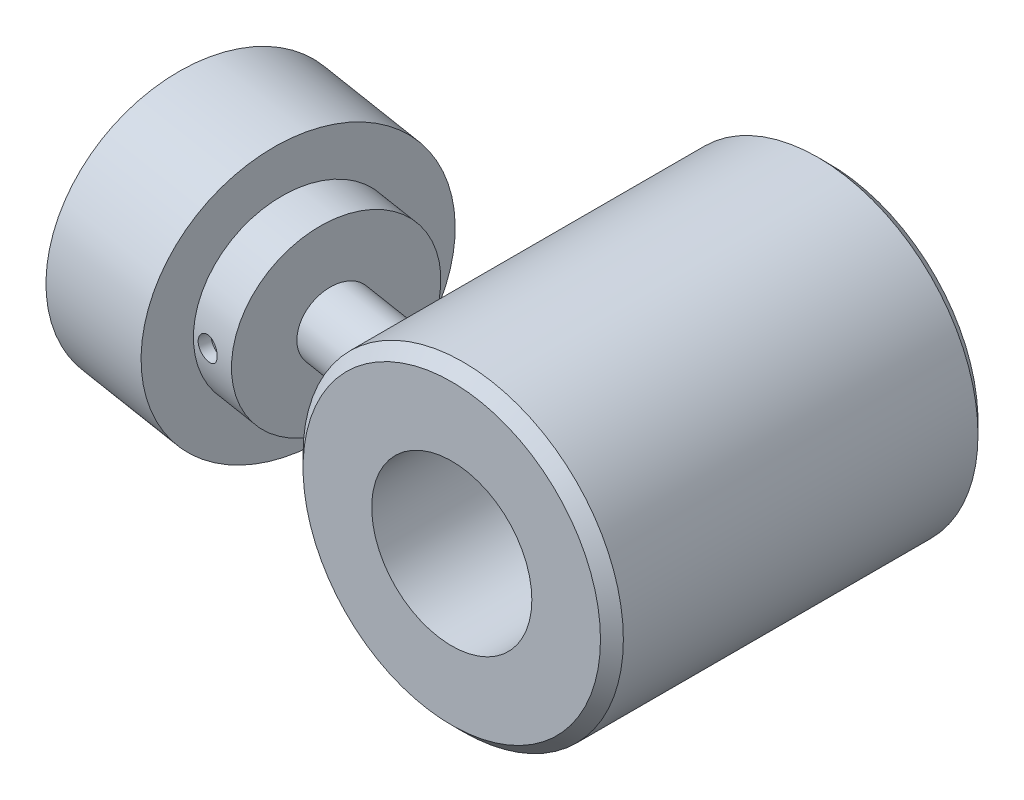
ISO-10303-21;
HEADER;
FILE_DESCRIPTION(('STEP AP214'),'2;1');
FILE_NAME('part.step','',(''),(''),'','','');
FILE_SCHEMA(('AUTOMOTIVE_DESIGN { 1 0 10303 214 1 1 1 1 }'));
ENDSEC;
DATA;
#1=APPLICATION_CONTEXT('core data for automotive mechanical design processes');
#2=APPLICATION_PROTOCOL_DEFINITION('international standard','automotive_design',2000,#1);
#3=PRODUCT_CONTEXT('',#1,'mechanical');
#4=PRODUCT('Part','Part','',(#3));
#5=PRODUCT_RELATED_PRODUCT_CATEGORY('part','',(#4));
#6=PRODUCT_DEFINITION_FORMATION('','',#4);
#7=PRODUCT_DEFINITION_CONTEXT('part definition',#1,'design');
#8=PRODUCT_DEFINITION('design','',#6,#7);
#9=PRODUCT_DEFINITION_SHAPE('','',#8);
#10=(LENGTH_UNIT() NAMED_UNIT(*) SI_UNIT(.MILLI.,.METRE.));
#11=(NAMED_UNIT(*) PLANE_ANGLE_UNIT() SI_UNIT($,.RADIAN.));
#12=(NAMED_UNIT(*) SI_UNIT($,.STERADIAN.) SOLID_ANGLE_UNIT());
#13=UNCERTAINTY_MEASURE_WITH_UNIT(LENGTH_MEASURE(1.E-05),#10,'distance_accuracy_value','');
#14=(GEOMETRIC_REPRESENTATION_CONTEXT(3) GLOBAL_UNCERTAINTY_ASSIGNED_CONTEXT((#13)) GLOBAL_UNIT_ASSIGNED_CONTEXT((#10,
#11,#12)) REPRESENTATION_CONTEXT('',''));
#15=CARTESIAN_POINT('',(0.,0.,0.));
#16=DIRECTION('',(0.,0.,1.));
#17=DIRECTION('',(1.,0.,0.));
#18=AXIS2_PLACEMENT_3D('',#15,#16,#17);
#19=CARTESIAN_POINT('',(-23.0393230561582,0.,8.41546242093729));
#20=DIRECTION('',(-0.156434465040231,0.,0.987688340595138));
#21=DIRECTION('',(-0.987688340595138,0.,-0.156434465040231));
#22=AXIS2_PLACEMENT_3D('',#19,#20,#21);
#23=CYLINDRICAL_SURFACE('',#22,1.);
#24=CARTESIAN_POINT('',(-27.155700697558,0.,28.0127947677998));
#25=CARTESIAN_POINT('',(-27.1556982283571,0.055936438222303,28.0127943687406));
#26=CARTESIAN_POINT('',(-27.1509567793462,0.111907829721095,28.0129458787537));
#27=CARTESIAN_POINT('',(-27.1321245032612,0.222293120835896,28.0135949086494));
#28=CARTESIAN_POINT('',(-27.1180239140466,0.276705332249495,28.0140927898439));
#29=CARTESIAN_POINT('',(-27.0809174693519,0.382358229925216,28.0155597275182));
#30=CARTESIAN_POINT('',(-27.0579176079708,0.433601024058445,28.0165284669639));
#31=CARTESIAN_POINT('',(-27.0037126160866,0.531511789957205,28.0191236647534));
#32=CARTESIAN_POINT('',(-26.972508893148,0.578180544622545,28.020750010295));
#33=CARTESIAN_POINT('',(-26.9026407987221,0.665885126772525,28.0248922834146));
#34=CARTESIAN_POINT('',(-26.8639405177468,0.706892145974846,28.0274125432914));
#35=CARTESIAN_POINT('',(-26.7803032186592,0.781861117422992,28.033566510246));
#36=CARTESIAN_POINT('',(-26.7353658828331,0.815822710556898,28.0372002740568));
#37=CARTESIAN_POINT('',(-26.6403888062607,0.875844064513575,28.0457826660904));
#38=CARTESIAN_POINT('',(-26.5903323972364,0.901876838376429,28.0507356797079));
#39=CARTESIAN_POINT('',(-26.4866962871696,0.945129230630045,28.0620611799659));
#40=CARTESIAN_POINT('',(-26.4331167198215,0.962349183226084,28.0684336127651));
#41=CARTESIAN_POINT('',(-26.3242802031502,0.987399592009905,28.082557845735));
#42=CARTESIAN_POINT('',(-26.269033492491,0.995278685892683,28.0903022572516));
#43=CARTESIAN_POINT('',(-26.158194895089,1.00157421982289,28.1070556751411));
#44=CARTESIAN_POINT('',(-26.1026030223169,0.999991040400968,28.1160646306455));
#45=CARTESIAN_POINT('',(-25.9929834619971,0.987446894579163,28.1350163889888));
#46=CARTESIAN_POINT('',(-25.9389486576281,0.976539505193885,28.1449535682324));
#47=CARTESIAN_POINT('',(-25.8336198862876,0.945740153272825,28.1654095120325));
#48=CARTESIAN_POINT('',(-25.7823259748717,0.925848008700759,28.1759282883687));
#49=CARTESIAN_POINT('',(-25.6837406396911,0.877586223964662,28.1970854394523));
#50=CARTESIAN_POINT('',(-25.6364606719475,0.849193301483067,28.2077240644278));
#51=CARTESIAN_POINT('',(-25.5473260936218,0.784752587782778,28.2285390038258));
#52=CARTESIAN_POINT('',(-25.5054717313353,0.74870444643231,28.2387152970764));
#53=CARTESIAN_POINT('',(-25.4280277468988,0.669679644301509,28.2581029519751));
#54=CARTESIAN_POINT('',(-25.392483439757,0.626656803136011,28.2673071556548));
#55=CARTESIAN_POINT('',(-25.3289712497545,0.535062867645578,28.2841171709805));
#56=CARTESIAN_POINT('',(-25.3010033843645,0.486491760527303,28.2917229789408));
#57=CARTESIAN_POINT('',(-25.253396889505,0.385144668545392,28.3048610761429));
#58=CARTESIAN_POINT('',(-25.2337610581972,0.33236727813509,28.3103926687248));
#59=CARTESIAN_POINT('',(-25.2033801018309,0.224123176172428,28.3190182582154));
#60=CARTESIAN_POINT('',(-25.1926345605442,0.16865659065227,28.3221123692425));
#61=CARTESIAN_POINT('',(-25.1803788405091,0.0570052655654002,28.3256452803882));
#62=CARTESIAN_POINT('',(-25.1788074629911,0.00082779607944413,28.3261016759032));
#63=CARTESIAN_POINT('',(-25.1847805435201,-0.110998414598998,28.3243760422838));
#64=CARTESIAN_POINT('',(-25.1923248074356,-0.166647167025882,28.3221940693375));
#65=CARTESIAN_POINT('',(-25.2162767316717,-0.275649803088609,28.3153475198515));
#66=CARTESIAN_POINT('',(-25.2326551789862,-0.329010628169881,28.3106911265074));
#67=CARTESIAN_POINT('',(-25.273806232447,-0.432139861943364,28.2992009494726));
#68=CARTESIAN_POINT('',(-25.2985791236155,-0.481908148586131,28.2923670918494));
#69=CARTESIAN_POINT('',(-25.3560011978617,-0.576721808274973,28.2769087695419));
#70=CARTESIAN_POINT('',(-25.3886903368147,-0.621741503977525,28.268275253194));
#71=CARTESIAN_POINT('',(-25.4610057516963,-0.705518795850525,28.249761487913));
#72=CARTESIAN_POINT('',(-25.5006323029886,-0.744276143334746,28.2398811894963));
#73=CARTESIAN_POINT('',(-25.5860158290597,-0.814652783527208,28.2193834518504));
#74=CARTESIAN_POINT('',(-25.631806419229,-0.846230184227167,28.2087621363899));
#75=CARTESIAN_POINT('',(-25.7281039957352,-0.901061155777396,28.1874115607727));
#76=CARTESIAN_POINT('',(-25.7786108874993,-0.92431489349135,28.1766823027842));
#77=CARTESIAN_POINT('',(-25.8828111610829,-0.961770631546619,28.1556770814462));
#78=CARTESIAN_POINT('',(-25.9364958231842,-0.975996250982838,28.1454000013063));
#79=CARTESIAN_POINT('',(-26.0456595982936,-0.995067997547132,28.125713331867));
#80=CARTESIAN_POINT('',(-26.1011386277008,-0.999914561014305,28.1163037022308));
#81=CARTESIAN_POINT('',(-26.2119130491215,-1.00008261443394,28.0987372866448));
#82=CARTESIAN_POINT('',(-26.2672070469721,-0.995469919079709,28.0905722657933));
#83=CARTESIAN_POINT('',(-26.3764141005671,-0.97698976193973,28.0755997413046));
#84=CARTESIAN_POINT('',(-26.4303271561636,-0.963122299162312,28.0687922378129));
#85=CARTESIAN_POINT('',(-26.5352104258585,-0.926546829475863,28.0565844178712));
#86=CARTESIAN_POINT('',(-26.5861816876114,-0.903841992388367,28.0511835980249));
#87=CARTESIAN_POINT('',(-26.683752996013,-0.850242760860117,28.0417148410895));
#88=CARTESIAN_POINT('',(-26.7303529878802,-0.819348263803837,28.037646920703));
#89=CARTESIAN_POINT('',(-26.8181523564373,-0.75000253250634,28.0306613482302));
#90=CARTESIAN_POINT('',(-26.8593136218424,-0.711502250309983,28.0277515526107));
#91=CARTESIAN_POINT('',(-26.9346839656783,-0.628140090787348,28.0229052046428));
#92=CARTESIAN_POINT('',(-26.9688914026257,-0.583276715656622,28.0209688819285));
#93=CARTESIAN_POINT('',(-27.0294489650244,-0.488266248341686,28.0178351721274));
#94=CARTESIAN_POINT('',(-27.0557687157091,-0.438099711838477,28.0166406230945));
#95=CARTESIAN_POINT('',(-27.0995506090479,-0.33407316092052,28.014793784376));
#96=CARTESIAN_POINT('',(-27.1170223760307,-0.280217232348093,28.0141409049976));
#97=CARTESIAN_POINT('',(-27.1384022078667,-0.188402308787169,28.0133748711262));
#98=CARTESIAN_POINT('',(-27.1448793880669,-0.15102226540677,28.0131549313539));
#99=CARTESIAN_POINT('',(-27.1535294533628,-0.0757668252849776,28.0128650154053));
#100=CARTESIAN_POINT('',(-27.1557023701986,-0.0378914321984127,28.0127950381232));
#101=CARTESIAN_POINT('',(-27.155700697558,0.,28.0127947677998));
#102=B_SPLINE_CURVE_WITH_KNOTS('',3,(#24,#25,#26,#27,#28,#29,#30,#31,#32,#33,#34,#35,#36,#37,
#38,#39,#40,#41,#42,#43,#44,#45,#46,#47,#48,#49,#50,#51,#52,#53,#54,#55,#56,#57,#58,#59,#60,#61,
#62,#63,#64,#65,#66,#67,#68,#69,#70,#71,#72,#73,#74,#75,#76,#77,#78,#79,#80,#81,#82,#83,#84,#85,
#86,#87,#88,#89,#90,#91,#92,#93,#94,#95,#96,#97,#98,#99,#100,#101),.UNSPECIFIED.,.T.,.F.,(4,2,2,
2,2,2,2,2,2,2,2,2,2,2,2,2,2,2,2,2,2,2,2,2,2,2,2,2,2,2,2,2,2,2,2,2,2,2,4),(0.,0.167670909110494,
0.335516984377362,0.503250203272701,0.670954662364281,0.839483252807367,1.00802043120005,
1.17712500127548,1.34622315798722,1.51443690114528,1.68264387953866,1.84989078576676,
2.01714108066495,2.18485370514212,2.35257400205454,2.52145391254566,2.69033421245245,
2.85927118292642,3.02820024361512,3.19600111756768,3.36379841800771,3.53104421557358,
3.69829569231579,3.86640961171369,4.03453020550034,4.20360788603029,4.37268217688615,
4.54131229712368,4.70993457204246,4.87738760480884,5.0448406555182,5.21223369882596,
5.37962883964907,5.54814095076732,5.71669279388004,5.8858856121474,6.05489399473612,
6.1684753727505,6.28205591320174),.UNSPECIFIED.);
#103=CARTESIAN_POINT('',(-27.155700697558,0.,28.0127947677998));
#104=VERTEX_POINT('',#103);
#105=EDGE_CURVE('E138',#104,#104,#102,.T.);
#106=ORIENTED_EDGE('',*,*,#105,.F.);
#107=EDGE_LOOP('',(#106));
#108=FACE_BOUND('',#107,.T.);
#109=CARTESIAN_POINT('',(-26.0115778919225,0.,27.1815408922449));
#110=DIRECTION('',(0.156434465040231,0.,-0.987688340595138));
#111=DIRECTION('',(-0.987688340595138,0.,-0.156434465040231));
#112=AXIS2_PLACEMENT_3D('',#109,#110,#111);
#113=CIRCLE('',#112,1.);
#114=CARTESIAN_POINT('',(-26.9992662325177,0.,27.0251064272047));
#115=VERTEX_POINT('',#114);
#116=EDGE_CURVE('E312',#115,#115,#113,.T.);
#117=ORIENTED_EDGE('',*,*,#116,.T.);
#118=EDGE_LOOP('',(#117));
#119=FACE_BOUND('',#118,.T.);
#120=ADVANCED_FACE('F15',(#108,#119),#23,.F.);
#121=CARTESIAN_POINT('',(-30.1019004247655,0.,19.4464415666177));
#122=DIRECTION('',(0.987688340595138,0.,0.156434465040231));
#123=DIRECTION('',(-0.156434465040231,0.,0.987688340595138));
#124=AXIS2_PLACEMENT_3D('',#121,#122,#123);
#125=CYLINDRICAL_SURFACE('',#124,3.);
#126=CARTESIAN_POINT('',(-14.,0.,25.0341274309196));
#127=CARTESIAN_POINT('',(-13.9999967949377,0.168510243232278,25.0341221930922));
#128=CARTESIAN_POINT('',(-13.9969271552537,0.337094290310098,25.020195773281));
#129=CARTESIAN_POINT('',(-13.9849715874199,0.669555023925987,24.9648179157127));
#130=CARTESIAN_POINT('',(-13.9760813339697,0.833428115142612,24.9233460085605));
#131=CARTESIAN_POINT('',(-13.9534610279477,1.15168232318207,24.8139527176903));
#132=CARTESIAN_POINT('',(-13.9397327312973,1.30606685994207,24.7460409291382));
#133=CARTESIAN_POINT('',(-13.9089449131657,1.60101990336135,24.585515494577));
#134=CARTESIAN_POINT('',(-13.8918858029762,1.74159011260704,24.4929048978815));
#135=CARTESIAN_POINT('',(-13.8563175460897,2.00503649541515,24.2853044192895));
#136=CARTESIAN_POINT('',(-13.8378075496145,2.12790217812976,24.1703013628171));
#137=CARTESIAN_POINT('',(-13.8014344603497,2.35230999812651,23.9210010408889));
#138=CARTESIAN_POINT('',(-13.7835713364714,2.45385316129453,23.7867047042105));
#139=CARTESIAN_POINT('',(-13.7506600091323,2.63201983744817,23.5035894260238));
#140=CARTESIAN_POINT('',(-13.7355918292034,2.70882333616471,23.3548861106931));
#141=CARTESIAN_POINT('',(-13.7098167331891,2.83640424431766,23.0463653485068));
#142=CARTESIAN_POINT('',(-13.6991093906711,2.88718419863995,22.8865489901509));
#143=CARTESIAN_POINT('',(-13.6833145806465,2.96113670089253,22.5620164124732));
#144=CARTESIAN_POINT('',(-13.678174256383,2.98456907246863,22.3973618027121));
#145=CARTESIAN_POINT('',(-13.6738246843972,3.00443368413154,22.0663677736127));
#146=CARTESIAN_POINT('',(-13.6746157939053,3.00086429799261,21.9000282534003));
#147=CARTESIAN_POINT('',(-13.6819874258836,2.9670717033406,21.568147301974));
#148=CARTESIAN_POINT('',(-13.6886395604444,2.93651878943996,21.4026412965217));
#149=CARTESIAN_POINT('',(-13.7070057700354,2.84955215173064,21.0788636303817));
#150=CARTESIAN_POINT('',(-13.7187209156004,2.79313295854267,20.9205935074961));
#151=CARTESIAN_POINT('',(-13.74639677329,2.65363814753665,20.6097298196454));
#152=CARTESIAN_POINT('',(-13.7624953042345,2.56967494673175,20.4575465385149));
#153=CARTESIAN_POINT('',(-13.7969051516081,2.37799586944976,20.169198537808));
#154=CARTESIAN_POINT('',(-13.8152169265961,2.27027506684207,20.0330371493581));
#155=CARTESIAN_POINT('',(-13.8524138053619,2.03114502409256,19.7778901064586));
#156=CARTESIAN_POINT('',(-13.8713028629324,1.89928479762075,19.6593264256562));
#157=CARTESIAN_POINT('',(-13.9070591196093,1.61676491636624,19.4468080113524));
#158=CARTESIAN_POINT('',(-13.9239266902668,1.46610872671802,19.3528487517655));
#159=CARTESIAN_POINT('',(-13.9531259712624,1.15495215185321,19.1955832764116));
#160=CARTESIAN_POINT('',(-13.9655807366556,0.99489434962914,19.1314266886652));
#161=CARTESIAN_POINT('',(-13.9851350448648,0.665674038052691,19.0323419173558));
#162=CARTESIAN_POINT('',(-13.9922370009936,0.496515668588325,18.9974005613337));
#163=CARTESIAN_POINT('',(-13.9999601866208,0.164539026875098,18.9594828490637));
#164=CARTESIAN_POINT('',(-14.0009354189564,0.00192682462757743,18.9547601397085));
#165=CARTESIAN_POINT('',(-13.9972387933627,-0.321677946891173,18.9728347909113));
#166=CARTESIAN_POINT('',(-13.9925677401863,-0.482670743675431,18.9956282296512));
#167=CARTESIAN_POINT('',(-13.9782819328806,-0.794662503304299,19.0669168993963));
#168=CARTESIAN_POINT('',(-13.9687839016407,-0.945806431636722,19.1148060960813));
#169=CARTESIAN_POINT('',(-13.9459117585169,-1.23817301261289,19.2341070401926));
#170=CARTESIAN_POINT('',(-13.932537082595,-1.37939421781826,19.3055222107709));
#171=CARTESIAN_POINT('',(-13.9027361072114,-1.65335871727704,19.472391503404));
#172=CARTESIAN_POINT('',(-13.886219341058,-1.78563190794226,19.5685998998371));
#173=CARTESIAN_POINT('',(-13.8521499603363,-2.03312031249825,19.7807508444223));
#174=CARTESIAN_POINT('',(-13.834597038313,-2.14833042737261,19.8966992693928));
#175=CARTESIAN_POINT('',(-13.7992103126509,-2.36528573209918,20.1523431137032));
#176=CARTESIAN_POINT('',(-13.7814176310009,-2.46588751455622,20.2930160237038));
#177=CARTESIAN_POINT('',(-13.7485751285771,-2.64287932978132,20.5891621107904));
#178=CARTESIAN_POINT('',(-13.7335258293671,-2.7192647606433,20.7446380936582));
#179=CARTESIAN_POINT('',(-13.7075647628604,-2.8472917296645,21.0703611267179));
#180=CARTESIAN_POINT('',(-13.6967658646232,-2.89826678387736,21.2408803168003));
#181=CARTESIAN_POINT('',(-13.6812453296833,-2.97067716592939,21.5883550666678));
#182=CARTESIAN_POINT('',(-13.6765226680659,-2.99211747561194,21.765309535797));
#183=CARTESIAN_POINT('',(-13.6738903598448,-3.00412361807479,22.1159975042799));
#184=CARTESIAN_POINT('',(-13.6758169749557,-2.99543143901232,22.2897039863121));
#185=CARTESIAN_POINT('',(-13.6859977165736,-2.94856526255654,22.6328985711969));
#186=CARTESIAN_POINT('',(-13.6942504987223,-2.91039752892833,22.8023875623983));
#187=CARTESIAN_POINT('',(-13.7157581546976,-2.80724460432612,23.1261522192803));
#188=CARTESIAN_POINT('',(-13.7288298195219,-2.74323434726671,23.2807515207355));
#189=CARTESIAN_POINT('',(-13.7585167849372,-2.59022388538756,23.5766639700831));
#190=CARTESIAN_POINT('',(-13.7751318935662,-2.50122503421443,23.717977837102));
#191=CARTESIAN_POINT('',(-13.8098952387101,-2.3015116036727,23.9823889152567));
#192=CARTESIAN_POINT('',(-13.8280309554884,-2.19096601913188,24.1056155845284));
#193=CARTESIAN_POINT('',(-13.8639494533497,-1.95079942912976,24.331919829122));
#194=CARTESIAN_POINT('',(-13.8817321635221,-1.82117463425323,24.434993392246));
#195=CARTESIAN_POINT('',(-13.915198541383,-1.54492775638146,24.6193716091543));
#196=CARTESIAN_POINT('',(-13.9308567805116,-1.3981333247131,24.700422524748));
#197=CARTESIAN_POINT('',(-13.958115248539,-1.09289844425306,24.8371247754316));
#198=CARTESIAN_POINT('',(-13.9697183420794,-0.934466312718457,24.892794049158));
#199=CARTESIAN_POINT('',(-13.9856285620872,-0.646628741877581,24.9679413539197));
#200=CARTESIAN_POINT('',(-13.9909861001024,-0.518637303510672,24.9927239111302));
#201=CARTESIAN_POINT('',(-13.9981730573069,-0.260445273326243,25.025818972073));
#202=CARTESIAN_POINT('',(-14.0000024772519,-0.130244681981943,25.0341314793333));
#203=CARTESIAN_POINT('',(-14.,0.,25.0341274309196));
#204=B_SPLINE_CURVE_WITH_KNOTS('',3,(#126,#127,#128,#129,#130,#131,#132,#133,#134,#135,#136,
#137,#138,#139,#140,#141,#142,#143,#144,#145,#146,#147,#148,#149,#150,#151,#152,#153,#154,#155,
#156,#157,#158,#159,#160,#161,#162,#163,#164,#165,#166,#167,#168,#169,#170,#171,#172,#173,#174,
#175,#176,#177,#178,#179,#180,#181,#182,#183,#184,#185,#186,#187,#188,#189,#190,#191,#192,#193,
#194,#195,#196,#197,#198,#199,#200,#201,#202,#203),.UNSPECIFIED.,.T.,.F.,(4,2,2,2,2,2,2,2,2,2,2,
2,2,2,2,2,2,2,2,2,2,2,2,2,2,2,2,2,2,2,2,2,2,2,2,2,2,2,4),(0.,0.505061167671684,1.01049807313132,
1.5157517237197,2.02094302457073,2.5264324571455,3.03189756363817,3.53359759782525,
4.03524856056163,4.53209361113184,5.02896858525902,5.53200007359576,6.03513797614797,
6.55641269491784,7.0777956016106,7.6101556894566,8.14241777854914,8.65838477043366,
9.17411899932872,9.65975715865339,10.1453261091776,10.6196755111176,11.0940939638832,
11.5851268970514,12.0763062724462,12.5955122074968,13.114816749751,13.6471065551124,
14.1793065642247,14.6984956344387,15.2175744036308,15.7186691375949,16.2197367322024,
16.7170219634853,17.2144060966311,17.7172988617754,18.21983565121,18.6102068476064,
19.000577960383),.UNSPECIFIED.);
#205=CARTESIAN_POINT('',(-14.,0.,25.0341274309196));
#206=VERTEX_POINT('',#205);
#207=EDGE_CURVE('E243',#206,#206,#204,.T.);
#208=ORIENTED_EDGE('',*,*,#207,.T.);
#209=EDGE_LOOP('',(#208));
#210=FACE_BOUND('',#209,.T.);
#211=CARTESIAN_POINT('',(-22.4473157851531,0.,20.6588086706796));
#212=DIRECTION('',(-0.987688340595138,0.,-0.156434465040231));
#213=DIRECTION('',(0.,-1.,0.));
#214=AXIS2_PLACEMENT_3D('',#211,#212,#213);
#215=CIRCLE('',#214,3.);
#216=CARTESIAN_POINT('',(-22.4473157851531,-3.,20.6588086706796));
#217=VERTEX_POINT('',#216);
#218=EDGE_CURVE('E250',#217,#217,#215,.T.);
#219=ORIENTED_EDGE('',*,*,#218,.F.);
#220=EDGE_LOOP('',(#219));
#221=FACE_BOUND('',#220,.T.);
#222=ADVANCED_FACE('F202',(#210,#221),#125,.T.);
#223=CARTESIAN_POINT('',(-28.3489050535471,0.,22.7614841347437));
#224=DIRECTION('',(-0.987688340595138,0.,-0.156434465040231));
#225=DIRECTION('',(0.156434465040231,0.,-0.987688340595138));
#226=AXIS2_PLACEMENT_3D('',#223,#224,#225);
#227=PLANE('',#226);
#228=DIRECTION('',(0.135476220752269,0.5,-0.855363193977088));
#229=VECTOR('',#228,1.);
#230=CARTESIAN_POINT('',(-28.1142533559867,0.866025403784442,21.279951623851));
#231=LINE('',#230,#229);
#232=CARTESIAN_POINT('',(-28.1142533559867,0.866025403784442,21.279951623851));
#233=VERTEX_POINT('',#232);
#234=CARTESIAN_POINT('',(-27.8796016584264,1.73205080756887,19.7984191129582));
#235=VERTEX_POINT('',#234);
#236=EDGE_CURVE('E341',#233,#235,#231,.T.);
#237=ORIENTED_EDGE('',*,*,#236,.T.);
#238=DIRECTION('',(-0.135476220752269,0.5,0.855363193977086));
#239=VECTOR('',#238,1.);
#240=CARTESIAN_POINT('',(-27.644949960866,0.866025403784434,18.3168866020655));
#241=LINE('',#240,#239);
#242=CARTESIAN_POINT('',(-27.644949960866,0.866025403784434,18.3168866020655));
#243=VERTEX_POINT('',#242);
#244=EDGE_CURVE('E345',#243,#235,#241,.T.);
#245=ORIENTED_EDGE('',*,*,#244,.F.);
#246=DIRECTION('',(0.,1.,0.));
#247=VECTOR('',#246,1.);
#248=CARTESIAN_POINT('',(-27.644949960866,-0.866025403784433,18.3168866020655));
#249=LINE('',#248,#247);
#250=CARTESIAN_POINT('',(-27.644949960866,-0.866025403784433,18.3168866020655));
#251=VERTEX_POINT('',#250);
#252=EDGE_CURVE('E348',#251,#243,#249,.T.);
#253=ORIENTED_EDGE('',*,*,#252,.F.);
#254=DIRECTION('',(-0.135476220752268,-0.5,0.855363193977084));
#255=VECTOR('',#254,1.);
#256=CARTESIAN_POINT('',(-27.644949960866,-0.866025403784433,18.3168866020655));
#257=LINE('',#256,#255);
#258=CARTESIAN_POINT('',(-27.8796016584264,-1.73205080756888,19.7984191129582));
#259=VERTEX_POINT('',#258);
#260=EDGE_CURVE('E351',#251,#259,#257,.T.);
#261=ORIENTED_EDGE('',*,*,#260,.T.);
#262=DIRECTION('',(0.135476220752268,-0.5,-0.855363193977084));
#263=VECTOR('',#262,1.);
#264=CARTESIAN_POINT('',(-28.1142533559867,-0.866025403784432,21.279951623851));
#265=LINE('',#264,#263);
#266=CARTESIAN_POINT('',(-28.1142533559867,-0.866025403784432,21.279951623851));
#267=VERTEX_POINT('',#266);
#268=EDGE_CURVE('E354',#267,#259,#265,.T.);
#269=ORIENTED_EDGE('',*,*,#268,.F.);
#270=DIRECTION('',(0.,1.,0.));
#271=VECTOR('',#270,1.);
#272=CARTESIAN_POINT('',(-28.1142533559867,-0.866025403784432,21.279951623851));
#273=LINE('',#272,#271);
#274=EDGE_CURVE('E324',#267,#233,#273,.T.);
#275=ORIENTED_EDGE('',*,*,#274,.T.);
#276=EDGE_LOOP('',(#237,#245,#253,#261,#269,#275));
#277=FACE_BOUND('',#276,.T.);
#278=ADVANCED_FACE('F198',(#277),#227,.T.);
#279=CARTESIAN_POINT('',(-27.644949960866,-0.866025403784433,18.3168866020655));
#280=DIRECTION('',(-0.156434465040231,0.,0.987688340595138));
#281=DIRECTION('',(0.,-1.,0.));
#282=AXIS2_PLACEMENT_3D('',#279,#280,#281);
#283=PLANE('',#282);
#284=DIRECTION('',(-0.987688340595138,0.,-0.156434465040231));
#285=VECTOR('',#284,1.);
#286=CARTESIAN_POINT('',(-27.644949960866,0.866025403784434,18.3168866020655));
#287=LINE('',#286,#285);
#288=CARTESIAN_POINT('',(-30.1141708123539,0.866025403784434,17.925800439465));
#289=VERTEX_POINT('',#288);
#290=EDGE_CURVE('E360',#243,#289,#287,.T.);
#291=ORIENTED_EDGE('',*,*,#290,.T.);
#292=DIRECTION('',(0.,1.,0.));
#293=VECTOR('',#292,1.);
#294=CARTESIAN_POINT('',(-30.1141708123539,-0.866025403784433,17.925800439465));
#295=LINE('',#294,#293);
#296=CARTESIAN_POINT('',(-30.1141708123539,-0.866025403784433,17.925800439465));
#297=VERTEX_POINT('',#296);
#298=EDGE_CURVE('E328',#297,#289,#295,.T.);
#299=ORIENTED_EDGE('',*,*,#298,.F.);
#300=DIRECTION('',(-0.987688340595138,0.,-0.156434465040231));
#301=VECTOR('',#300,1.);
#302=CARTESIAN_POINT('',(-27.644949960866,-0.866025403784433,18.3168866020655));
#303=LINE('',#302,#301);
#304=EDGE_CURVE('E363',#251,#297,#303,.T.);
#305=ORIENTED_EDGE('',*,*,#304,.F.);
#306=ORIENTED_EDGE('',*,*,#252,.T.);
#307=EDGE_LOOP('',(#291,#299,#305,#306));
#308=FACE_BOUND('',#307,.T.);
#309=ADVANCED_FACE('F201',(#308),#283,.T.);
#310=CARTESIAN_POINT('',(-27.644949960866,-0.866025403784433,18.3168866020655));
#311=DIRECTION('',(0.0782172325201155,-0.866025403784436,-0.493844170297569));
#312=DIRECTION('',(0.135476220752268,0.5,-0.855363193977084));
#313=AXIS2_PLACEMENT_3D('',#310,#311,#312);
#314=PLANE('',#313);
#315=ORIENTED_EDGE('',*,*,#304,.T.);
#316=DIRECTION('',(-0.135476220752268,-0.5,0.855363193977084));
#317=VECTOR('',#316,1.);
#318=CARTESIAN_POINT('',(-30.1141708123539,-0.866025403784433,17.925800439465));
#319=LINE('',#318,#317);
#320=CARTESIAN_POINT('',(-30.3488225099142,-1.73205080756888,19.4073329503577));
#321=VERTEX_POINT('',#320);
#322=EDGE_CURVE('E331',#297,#321,#319,.T.);
#323=ORIENTED_EDGE('',*,*,#322,.T.);
#324=DIRECTION('',(-0.987688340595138,0.,-0.156434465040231));
#325=VECTOR('',#324,1.);
#326=CARTESIAN_POINT('',(-27.8796016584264,-1.73205080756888,19.7984191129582));
#327=LINE('',#326,#325);
#328=EDGE_CURVE('E366',#259,#321,#327,.T.);
#329=ORIENTED_EDGE('',*,*,#328,.F.);
#330=ORIENTED_EDGE('',*,*,#260,.F.);
#331=EDGE_LOOP('',(#315,#323,#329,#330));
#332=FACE_BOUND('',#331,.T.);
#333=ADVANCED_FACE('F216',(#332),#314,.F.);
#334=CARTESIAN_POINT('',(-28.1142533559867,-0.866025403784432,21.279951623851));
#335=DIRECTION('',(0.0782172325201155,0.866025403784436,-0.493844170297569));
#336=DIRECTION('',(-0.135476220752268,0.5,0.855363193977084));
#337=AXIS2_PLACEMENT_3D('',#334,#335,#336);
#338=PLANE('',#337);
#339=ORIENTED_EDGE('',*,*,#328,.T.);
#340=DIRECTION('',(0.135476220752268,-0.5,-0.855363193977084));
#341=VECTOR('',#340,1.);
#342=CARTESIAN_POINT('',(-30.5834742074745,-0.866025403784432,20.8888654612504));
#343=LINE('',#342,#341);
#344=CARTESIAN_POINT('',(-30.5834742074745,-0.866025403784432,20.8888654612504));
#345=VERTEX_POINT('',#344);
#346=EDGE_CURVE('E335',#345,#321,#343,.T.);
#347=ORIENTED_EDGE('',*,*,#346,.F.);
#348=DIRECTION('',(-0.987688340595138,0.,-0.156434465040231));
#349=VECTOR('',#348,1.);
#350=CARTESIAN_POINT('',(-28.1142533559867,-0.866025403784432,21.279951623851));
#351=LINE('',#350,#349);
#352=EDGE_CURVE('E369',#267,#345,#351,.T.);
#353=ORIENTED_EDGE('',*,*,#352,.F.);
#354=ORIENTED_EDGE('',*,*,#268,.T.);
#355=EDGE_LOOP('',(#339,#347,#353,#354));
#356=FACE_BOUND('',#355,.T.);
#357=ADVANCED_FACE('F220',(#356),#338,.T.);
#358=CARTESIAN_POINT('',(-28.1142533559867,-0.866025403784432,21.279951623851));
#359=DIRECTION('',(-0.156434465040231,0.,0.987688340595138));
#360=DIRECTION('',(0.,-1.,0.));
#361=AXIS2_PLACEMENT_3D('',#358,#359,#360);
#362=PLANE('',#361);
#363=ORIENTED_EDGE('',*,*,#352,.T.);
#364=DIRECTION('',(0.,1.,0.));
#365=VECTOR('',#364,1.);
#366=CARTESIAN_POINT('',(-30.5834742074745,-0.866025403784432,20.8888654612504));
#367=LINE('',#366,#365);
#368=CARTESIAN_POINT('',(-30.5834742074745,0.866025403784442,20.8888654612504));
#369=VERTEX_POINT('',#368);
#370=EDGE_CURVE('E332',#345,#369,#367,.T.);
#371=ORIENTED_EDGE('',*,*,#370,.T.);
#372=DIRECTION('',(-0.987688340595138,0.,-0.156434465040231));
#373=VECTOR('',#372,1.);
#374=CARTESIAN_POINT('',(-28.1142533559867,0.866025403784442,21.279951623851));
#375=LINE('',#374,#373);
#376=EDGE_CURVE('E372',#233,#369,#375,.T.);
#377=ORIENTED_EDGE('',*,*,#376,.F.);
#378=ORIENTED_EDGE('',*,*,#274,.F.);
#379=EDGE_LOOP('',(#363,#371,#377,#378));
#380=FACE_BOUND('',#379,.T.);
#381=ADVANCED_FACE('F209',(#380),#362,.F.);
#382=CARTESIAN_POINT('',(-28.1142533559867,0.866025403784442,21.279951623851));
#383=DIRECTION('',(-0.0782172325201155,0.86602540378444,0.493844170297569));
#384=DIRECTION('',(-0.135476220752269,-0.5,0.855363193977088));
#385=AXIS2_PLACEMENT_3D('',#382,#383,#384);
#386=PLANE('',#385);
#387=ORIENTED_EDGE('',*,*,#376,.T.);
#388=DIRECTION('',(0.135476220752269,0.5,-0.855363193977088));
#389=VECTOR('',#388,1.);
#390=CARTESIAN_POINT('',(-30.5834742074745,0.866025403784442,20.8888654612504));
#391=LINE('',#390,#389);
#392=CARTESIAN_POINT('',(-30.3488225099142,1.73205080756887,19.4073329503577));
#393=VERTEX_POINT('',#392);
#394=EDGE_CURVE('E39',#369,#393,#391,.T.);
#395=ORIENTED_EDGE('',*,*,#394,.T.);
#396=DIRECTION('',(-0.987688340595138,0.,-0.156434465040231));
#397=VECTOR('',#396,1.);
#398=CARTESIAN_POINT('',(-27.8796016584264,1.73205080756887,19.7984191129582));
#399=LINE('',#398,#397);
#400=EDGE_CURVE('E344',#235,#393,#399,.T.);
#401=ORIENTED_EDGE('',*,*,#400,.F.);
#402=ORIENTED_EDGE('',*,*,#236,.F.);
#403=EDGE_LOOP('',(#387,#395,#401,#402));
#404=FACE_BOUND('',#403,.T.);
#405=ADVANCED_FACE('F205',(#404),#386,.F.);
#406=CARTESIAN_POINT('',(-27.644949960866,0.866025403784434,18.3168866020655));
#407=DIRECTION('',(-0.0782172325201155,-0.866025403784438,0.493844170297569));
#408=DIRECTION('',(0.135476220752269,-0.5,-0.855363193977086));
#409=AXIS2_PLACEMENT_3D('',#406,#407,#408);
#410=PLANE('',#409);
#411=ORIENTED_EDGE('',*,*,#244,.T.);
#412=ORIENTED_EDGE('',*,*,#400,.T.);
#413=DIRECTION('',(-0.135476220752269,0.5,0.855363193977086));
#414=VECTOR('',#413,1.);
#415=CARTESIAN_POINT('',(-30.1141708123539,0.866025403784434,17.925800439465));
#416=LINE('',#415,#414);
#417=EDGE_CURVE('E325',#289,#393,#416,.T.);
#418=ORIENTED_EDGE('',*,*,#417,.F.);
#419=ORIENTED_EDGE('',*,*,#290,.F.);
#420=EDGE_LOOP('',(#411,#412,#418,#419));
#421=FACE_BOUND('',#420,.T.);
#422=ADVANCED_FACE('F208',(#421),#410,.T.);
#423=CARTESIAN_POINT('',(-30.3488225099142,0.,19.4073329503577));
#424=DIRECTION('',(0.987688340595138,0.,0.156434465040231));
#425=DIRECTION('',(-0.156434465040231,0.,0.987688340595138));
#426=AXIS2_PLACEMENT_3D('',#423,#424,#425);
#427=PLANE('',#426);
#428=ORIENTED_EDGE('',*,*,#417,.T.);
#429=ORIENTED_EDGE('',*,*,#394,.F.);
#430=ORIENTED_EDGE('',*,*,#370,.F.);
#431=ORIENTED_EDGE('',*,*,#346,.T.);
#432=ORIENTED_EDGE('',*,*,#322,.F.);
#433=ORIENTED_EDGE('',*,*,#298,.T.);
#434=EDGE_LOOP('',(#428,#429,#430,#431,#432,#433));
#435=FACE_BOUND('',#434,.T.);
#436=CARTESIAN_POINT('',(-30.3488225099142,0.,19.4073329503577));
#437=DIRECTION('',(0.987688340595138,0.,0.156434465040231));
#438=DIRECTION('',(-0.156434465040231,0.,0.987688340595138));
#439=AXIS2_PLACEMENT_3D('',#436,#437,#438);
#440=CIRCLE('',#439,2.5);
#441=CARTESIAN_POINT('',(-30.7399086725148,0.,21.8765538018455));
#442=VERTEX_POINT('',#441);
#443=EDGE_CURVE('E373',#442,#442,#440,.T.);
#444=ORIENTED_EDGE('',*,*,#443,.F.);
#445=EDGE_LOOP('',(#444));
#446=FACE_BOUND('',#445,.T.);
#447=ADVANCED_FACE('F212',(#435,#446),#427,.F.);
#448=CARTESIAN_POINT('',(-29.8549783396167,0.,19.4855501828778));
#449=DIRECTION('',(0.987688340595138,0.,0.156434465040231));
#450=DIRECTION('',(-0.156434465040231,0.,0.987688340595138));
#451=AXIS2_PLACEMENT_3D('',#448,#449,#450);
#452=CONICAL_SURFACE('',#451,3.,0.785398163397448);
#453=ORIENTED_EDGE('',*,*,#443,.T.);
#454=EDGE_LOOP('',(#453));
#455=FACE_BOUND('',#454,.T.);
#456=CARTESIAN_POINT('',(-29.8549783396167,0.,19.4855501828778));
#457=DIRECTION('',(0.987688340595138,0.,0.156434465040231));
#458=DIRECTION('',(-0.156434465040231,0.,0.987688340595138));
#459=AXIS2_PLACEMENT_3D('',#456,#457,#458);
#460=CIRCLE('',#459,3.);
#461=CARTESIAN_POINT('',(-30.3242817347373,0.,22.4486152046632));
#462=VERTEX_POINT('',#461);
#463=EDGE_CURVE('E251',#462,#462,#460,.T.);
#464=ORIENTED_EDGE('',*,*,#463,.F.);
#465=EDGE_LOOP('',(#464));
#466=FACE_BOUND('',#465,.T.);
#467=ADVANCED_FACE('F230',(#455,#466),#452,.T.);
#468=CARTESIAN_POINT('',(0.,-11.,22.1547005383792));
#469=DIRECTION('',(0.,-1.,0.));
#470=DIRECTION('',(1.,0.,0.));
#471=AXIS2_PLACEMENT_3D('',#468,#469,#470);
#472=PLANE('',#471);
#473=DIRECTION('',(-0.866025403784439,0.,0.5));
#474=VECTOR('',#473,1.);
#475=CARTESIAN_POINT('',(1.,-11.,21.5773502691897));
#476=LINE('',#475,#474);
#477=CARTESIAN_POINT('',(1.,-11.,21.5773502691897));
#478=VERTEX_POINT('',#477);
#479=CARTESIAN_POINT('',(0.,-11.,22.1547005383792));
#480=VERTEX_POINT('',#479);
#481=EDGE_CURVE('E87',#478,#480,#476,.T.);
#482=ORIENTED_EDGE('',*,*,#481,.T.);
#483=DIRECTION('',(-0.866025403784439,0.,-0.5));
#484=VECTOR('',#483,1.);
#485=CARTESIAN_POINT('',(0.,-11.,22.1547005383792));
#486=LINE('',#485,#484);
#487=CARTESIAN_POINT('',(-1.,-11.,21.5773502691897));
#488=VERTEX_POINT('',#487);
#489=EDGE_CURVE('E410',#480,#488,#486,.T.);
#490=ORIENTED_EDGE('',*,*,#489,.T.);
#491=DIRECTION('',(0.,0.,-1.));
#492=VECTOR('',#491,1.);
#493=CARTESIAN_POINT('',(-1.,-11.,21.5773502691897));
#494=LINE('',#493,#492);
#495=CARTESIAN_POINT('',(-1.,-11.,20.4226497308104));
#496=VERTEX_POINT('',#495);
#497=EDGE_CURVE('E413',#488,#496,#494,.T.);
#498=ORIENTED_EDGE('',*,*,#497,.T.);
#499=DIRECTION('',(0.866025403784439,0.,-0.5));
#500=VECTOR('',#499,1.);
#501=CARTESIAN_POINT('',(-1.,-11.,20.4226497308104));
#502=LINE('',#501,#500);
#503=CARTESIAN_POINT('',(0.,-11.,19.8452994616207));
#504=VERTEX_POINT('',#503);
#505=EDGE_CURVE('E416',#496,#504,#502,.T.);
#506=ORIENTED_EDGE('',*,*,#505,.T.);
#507=DIRECTION('',(0.866025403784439,0.,0.5));
#508=VECTOR('',#507,1.);
#509=CARTESIAN_POINT('',(0.,-11.,19.8452994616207));
#510=LINE('',#509,#508);
#511=CARTESIAN_POINT('',(1.,-11.,20.4226497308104));
#512=VERTEX_POINT('',#511);
#513=EDGE_CURVE('E418',#504,#512,#510,.T.);
#514=ORIENTED_EDGE('',*,*,#513,.T.);
#515=DIRECTION('',(0.,0.,1.));
#516=VECTOR('',#515,1.);
#517=CARTESIAN_POINT('',(1.,-11.,20.4226497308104));
#518=LINE('',#517,#516);
#519=EDGE_CURVE('E115',#512,#478,#518,.T.);
#520=ORIENTED_EDGE('',*,*,#519,.T.);
#521=EDGE_LOOP('',(#482,#490,#498,#506,#514,#520));
#522=FACE_BOUND('',#521,.T.);
#523=ADVANCED_FACE('F234',(#522),#472,.T.);
#524=CARTESIAN_POINT('',(0.,-11.,22.1547005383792));
#525=DIRECTION('',(-0.5,0.,0.866025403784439));
#526=DIRECTION('',(-0.866025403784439,0.,-0.5));
#527=AXIS2_PLACEMENT_3D('',#524,#525,#526);
#528=PLANE('',#527);
#529=DIRECTION('',(-0.866025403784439,0.,-0.5));
#530=VECTOR('',#529,1.);
#531=CARTESIAN_POINT('',(0.,-12.5,22.1547005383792));
#532=LINE('',#531,#530);
#533=CARTESIAN_POINT('',(0.,-12.5,22.1547005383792));
#534=VERTEX_POINT('',#533);
#535=CARTESIAN_POINT('',(-1.,-12.5,21.5773502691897));
#536=VERTEX_POINT('',#535);
#537=EDGE_CURVE('E107',#534,#536,#532,.T.);
#538=ORIENTED_EDGE('',*,*,#537,.T.);
#539=DIRECTION('',(0.,-1.,0.));
#540=VECTOR('',#539,1.);
#541=CARTESIAN_POINT('',(-1.,-11.,21.5773502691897));
#542=LINE('',#541,#540);
#543=EDGE_CURVE('E129',#488,#536,#542,.T.);
#544=ORIENTED_EDGE('',*,*,#543,.F.);
#545=ORIENTED_EDGE('',*,*,#489,.F.);
#546=DIRECTION('',(0.,-1.,0.));
#547=VECTOR('',#546,1.);
#548=CARTESIAN_POINT('',(0.,-11.,22.1547005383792));
#549=LINE('',#548,#547);
#550=EDGE_CURVE('E131',#480,#534,#549,.T.);
#551=ORIENTED_EDGE('',*,*,#550,.T.);
#552=EDGE_LOOP('',(#538,#544,#545,#551));
#553=FACE_BOUND('',#552,.T.);
#554=ADVANCED_FACE('F278',(#553),#528,.F.);
#555=CARTESIAN_POINT('',(-1.,-11.,21.5773502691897));
#556=DIRECTION('',(-1.,0.,0.));
#557=DIRECTION('',(0.,0.,-1.));
#558=AXIS2_PLACEMENT_3D('',#555,#556,#557);
#559=PLANE('',#558);
#560=DIRECTION('',(0.,0.,-1.));
#561=VECTOR('',#560,1.);
#562=CARTESIAN_POINT('',(-1.,-12.5,21.5773502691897));
#563=LINE('',#562,#561);
#564=CARTESIAN_POINT('',(-1.,-12.5,20.4226497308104));
#565=VERTEX_POINT('',#564);
#566=EDGE_CURVE('E110',#536,#565,#563,.T.);
#567=ORIENTED_EDGE('',*,*,#566,.T.);
#568=DIRECTION('',(0.,-1.,0.));
#569=VECTOR('',#568,1.);
#570=CARTESIAN_POINT('',(-1.,-11.,20.4226497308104));
#571=LINE('',#570,#569);
#572=EDGE_CURVE('E127',#496,#565,#571,.T.);
#573=ORIENTED_EDGE('',*,*,#572,.F.);
#574=ORIENTED_EDGE('',*,*,#497,.F.);
#575=ORIENTED_EDGE('',*,*,#543,.T.);
#576=EDGE_LOOP('',(#567,#573,#574,#575));
#577=FACE_BOUND('',#576,.T.);
#578=ADVANCED_FACE('F289',(#577),#559,.F.);
#579=CARTESIAN_POINT('',(-1.,-11.,20.4226497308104));
#580=DIRECTION('',(-0.5,0.,-0.866025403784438));
#581=DIRECTION('',(0.866025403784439,0.,-0.5));
#582=AXIS2_PLACEMENT_3D('',#579,#580,#581);
#583=PLANE('',#582);
#584=DIRECTION('',(0.866025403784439,0.,-0.5));
#585=VECTOR('',#584,1.);
#586=CARTESIAN_POINT('',(-1.,-12.5,20.4226497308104));
#587=LINE('',#586,#585);
#588=CARTESIAN_POINT('',(0.,-12.5,19.8452994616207));
#589=VERTEX_POINT('',#588);
#590=EDGE_CURVE('E120',#565,#589,#587,.T.);
#591=ORIENTED_EDGE('',*,*,#590,.T.);
#592=DIRECTION('',(0.,-1.,0.));
#593=VECTOR('',#592,1.);
#594=CARTESIAN_POINT('',(0.,-11.,19.8452994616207));
#595=LINE('',#594,#593);
#596=EDGE_CURVE('E125',#504,#589,#595,.T.);
#597=ORIENTED_EDGE('',*,*,#596,.F.);
#598=ORIENTED_EDGE('',*,*,#505,.F.);
#599=ORIENTED_EDGE('',*,*,#572,.T.);
#600=EDGE_LOOP('',(#591,#597,#598,#599));
#601=FACE_BOUND('',#600,.T.);
#602=ADVANCED_FACE('F285',(#601),#583,.F.);
#603=CARTESIAN_POINT('',(0.,-11.,19.8452994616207));
#604=DIRECTION('',(0.5,0.,-0.866025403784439));
#605=DIRECTION('',(0.866025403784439,0.,0.5));
#606=AXIS2_PLACEMENT_3D('',#603,#604,#605);
#607=PLANE('',#606);
#608=DIRECTION('',(0.866025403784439,0.,0.5));
#609=VECTOR('',#608,1.);
#610=CARTESIAN_POINT('',(0.,-12.5,19.8452994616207));
#611=LINE('',#610,#609);
#612=CARTESIAN_POINT('',(1.,-12.5,20.4226497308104));
#613=VERTEX_POINT('',#612);
#614=EDGE_CURVE('E100',#589,#613,#611,.T.);
#615=ORIENTED_EDGE('',*,*,#614,.T.);
#616=DIRECTION('',(0.,-1.,0.));
#617=VECTOR('',#616,1.);
#618=CARTESIAN_POINT('',(1.,-11.,20.4226497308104));
#619=LINE('',#618,#617);
#620=EDGE_CURVE('E92',#512,#613,#619,.T.);
#621=ORIENTED_EDGE('',*,*,#620,.F.);
#622=ORIENTED_EDGE('',*,*,#513,.F.);
#623=ORIENTED_EDGE('',*,*,#596,.T.);
#624=EDGE_LOOP('',(#615,#621,#622,#623));
#625=FACE_BOUND('',#624,.T.);
#626=ADVANCED_FACE('F282',(#625),#607,.F.);
#627=CARTESIAN_POINT('',(1.,-11.,20.4226497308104));
#628=DIRECTION('',(1.,0.,0.));
#629=DIRECTION('',(0.,1.,0.));
#630=AXIS2_PLACEMENT_3D('',#627,#628,#629);
#631=PLANE('',#630);
#632=DIRECTION('',(0.,0.,1.));
#633=VECTOR('',#632,1.);
#634=CARTESIAN_POINT('',(1.,-12.5,20.4226497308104));
#635=LINE('',#634,#633);
#636=CARTESIAN_POINT('',(1.,-12.5,21.5773502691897));
#637=VERTEX_POINT('',#636);
#638=EDGE_CURVE('E95',#613,#637,#635,.T.);
#639=ORIENTED_EDGE('',*,*,#638,.T.);
#640=DIRECTION('',(0.,-1.,0.));
#641=VECTOR('',#640,1.);
#642=CARTESIAN_POINT('',(1.,-11.,21.5773502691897));
#643=LINE('',#642,#641);
#644=EDGE_CURVE('E80',#478,#637,#643,.T.);
#645=ORIENTED_EDGE('',*,*,#644,.F.);
#646=ORIENTED_EDGE('',*,*,#519,.F.);
#647=ORIENTED_EDGE('',*,*,#620,.T.);
#648=EDGE_LOOP('',(#639,#645,#646,#647));
#649=FACE_BOUND('',#648,.T.);
#650=ADVANCED_FACE('F96',(#649),#631,.F.);
#651=CARTESIAN_POINT('',(1.,-11.,21.5773502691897));
#652=DIRECTION('',(0.5,0.,0.866025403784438));
#653=DIRECTION('',(-0.866025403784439,0.,0.5));
#654=AXIS2_PLACEMENT_3D('',#651,#652,#653);
#655=PLANE('',#654);
#656=DIRECTION('',(-0.866025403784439,0.,0.5));
#657=VECTOR('',#656,1.);
#658=CARTESIAN_POINT('',(1.,-12.5,21.5773502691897));
#659=LINE('',#658,#657);
#660=EDGE_CURVE('E84',#637,#534,#659,.T.);
#661=ORIENTED_EDGE('',*,*,#660,.T.);
#662=ORIENTED_EDGE('',*,*,#550,.F.);
#663=ORIENTED_EDGE('',*,*,#481,.F.);
#664=ORIENTED_EDGE('',*,*,#644,.T.);
#665=EDGE_LOOP('',(#661,#662,#663,#664));
#666=FACE_BOUND('',#665,.T.);
#667=ADVANCED_FACE('F82',(#666),#655,.F.);
#668=CARTESIAN_POINT('',(0.,0.,0.));
#669=DIRECTION('',(0.,0.,1.));
#670=DIRECTION('',(1.,0.,0.));
#671=AXIS2_PLACEMENT_3D('',#668,#669,#670);
#672=CYLINDRICAL_SURFACE('',#671,3.3);
#673=CARTESIAN_POINT('',(0.,0.,0.));
#674=DIRECTION('',(0.,0.,1.));
#675=DIRECTION('',(1.,0.,0.));
#676=AXIS2_PLACEMENT_3D('',#673,#674,#675);
#677=CIRCLE('',#676,3.3);
#678=CARTESIAN_POINT('',(3.3,0.,0.));
#679=VERTEX_POINT('',#678);
#680=EDGE_CURVE('E826',#679,#679,#677,.T.);
#681=ORIENTED_EDGE('',*,*,#680,.F.);
#682=EDGE_LOOP('',(#681));
#683=FACE_BOUND('',#682,.T.);
#684=CARTESIAN_POINT('',(0.,0.,6.));
#685=DIRECTION('',(0.,0.,1.));
#686=DIRECTION('',(1.,0.,0.));
#687=AXIS2_PLACEMENT_3D('',#684,#685,#686);
#688=CIRCLE('',#687,3.3);
#689=CARTESIAN_POINT('',(3.3,0.,6.));
#690=VERTEX_POINT('',#689);
#691=EDGE_CURVE('E815',#690,#690,#688,.T.);
#692=ORIENTED_EDGE('',*,*,#691,.T.);
#693=EDGE_LOOP('',(#692));
#694=FACE_BOUND('',#693,.T.);
#695=ADVANCED_FACE('F298',(#683,#694),#672,.F.);
#696=CARTESIAN_POINT('',(7.,0.,6.));
#697=DIRECTION('',(0.,0.,-1.));
#698=DIRECTION('',(-1.,0.,0.));
#699=AXIS2_PLACEMENT_3D('',#696,#697,#698);
#700=PLANE('',#699);
#701=ORIENTED_EDGE('',*,*,#691,.F.);
#702=EDGE_LOOP('',(#701));
#703=FACE_BOUND('',#702,.T.);
#704=CARTESIAN_POINT('',(0.,0.,6.));
#705=DIRECTION('',(0.,0.,1.));
#706=DIRECTION('',(1.,0.,0.));
#707=AXIS2_PLACEMENT_3D('',#704,#705,#706);
#708=CIRCLE('',#707,7.);
#709=CARTESIAN_POINT('',(7.,0.,6.));
#710=VERTEX_POINT('',#709);
#711=EDGE_CURVE('E817',#710,#710,#708,.T.);
#712=ORIENTED_EDGE('',*,*,#711,.T.);
#713=EDGE_LOOP('',(#712));
#714=FACE_BOUND('',#713,.T.);
#715=ADVANCED_FACE('F581',(#703,#714),#700,.F.);
#716=CARTESIAN_POINT('',(0.,-12.5,21.));
#717=DIRECTION('',(0.,-1.,0.));
#718=DIRECTION('',(1.,0.,0.));
#719=AXIS2_PLACEMENT_3D('',#716,#717,#718);
#720=PLANE('',#719);
#721=ORIENTED_EDGE('',*,*,#660,.F.);
#722=ORIENTED_EDGE('',*,*,#638,.F.);
#723=ORIENTED_EDGE('',*,*,#614,.F.);
#724=ORIENTED_EDGE('',*,*,#590,.F.);
#725=ORIENTED_EDGE('',*,*,#566,.F.);
#726=ORIENTED_EDGE('',*,*,#537,.F.);
#727=EDGE_LOOP('',(#721,#722,#723,#724,#725,#726));
#728=FACE_BOUND('',#727,.T.);
#729=CARTESIAN_POINT('',(0.,-12.5,21.));
#730=DIRECTION('',(0.,-1.,0.));
#731=DIRECTION('',(1.,0.,0.));
#732=AXIS2_PLACEMENT_3D('',#729,#730,#731);
#733=CIRCLE('',#732,2.);
#734=CARTESIAN_POINT('',(2.,-12.5,21.));
#735=VERTEX_POINT('',#734);
#736=EDGE_CURVE('E135',#735,#735,#733,.T.);
#737=ORIENTED_EDGE('',*,*,#736,.T.);
#738=EDGE_LOOP('',(#737));
#739=FACE_BOUND('',#738,.T.);
#740=ADVANCED_FACE('F103',(#728,#739),#720,.T.);
#741=CARTESIAN_POINT('',(0.,0.,0.));
#742=DIRECTION('',(0.,0.,1.));
#743=DIRECTION('',(1.,0.,0.));
#744=AXIS2_PLACEMENT_3D('',#741,#742,#743);
#745=CYLINDRICAL_SURFACE('',#744,7.);
#746=CARTESIAN_POINT('',(0.,0.,33.));
#747=DIRECTION('',(0.,0.,1.));
#748=DIRECTION('',(1.,0.,0.));
#749=AXIS2_PLACEMENT_3D('',#746,#747,#748);
#750=CIRCLE('',#749,7.);
#751=CARTESIAN_POINT('',(7.,0.,33.));
#752=VERTEX_POINT('',#751);
#753=EDGE_CURVE('E821',#752,#752,#750,.T.);
#754=ORIENTED_EDGE('',*,*,#753,.T.);
#755=EDGE_LOOP('',(#754));
#756=FACE_BOUND('',#755,.T.);
#757=ORIENTED_EDGE('',*,*,#711,.F.);
#758=EDGE_LOOP('',(#757));
#759=FACE_BOUND('',#758,.T.);
#760=ADVANCED_FACE('F557',(#756,#759),#745,.F.);
#761=CARTESIAN_POINT('',(0.,0.,33.));
#762=DIRECTION('',(0.,0.,1.));
#763=DIRECTION('',(1.,0.,0.));
#764=AXIS2_PLACEMENT_3D('',#761,#762,#763);
#765=PLANE('',#764);
#766=CARTESIAN_POINT('',(0.,0.,33.));
#767=DIRECTION('',(0.,0.,1.));
#768=DIRECTION('',(1.,0.,0.));
#769=AXIS2_PLACEMENT_3D('',#766,#767,#768);
#770=CIRCLE('',#769,13.);
#771=CARTESIAN_POINT('',(13.,0.,33.));
#772=VERTEX_POINT('',#771);
#773=EDGE_CURVE('E108',#772,#772,#770,.T.);
#774=ORIENTED_EDGE('',*,*,#773,.T.);
#775=EDGE_LOOP('',(#774));
#776=FACE_BOUND('',#775,.T.);
#777=ORIENTED_EDGE('',*,*,#753,.F.);
#778=EDGE_LOOP('',(#777));
#779=FACE_BOUND('',#778,.T.);
#780=ADVANCED_FACE('F596',(#776,#779),#765,.T.);
#781=CARTESIAN_POINT('',(14.,0.,0.));
#782=DIRECTION('',(0.,0.,-1.));
#783=DIRECTION('',(-1.,0.,0.));
#784=AXIS2_PLACEMENT_3D('',#781,#782,#783);
#785=PLANE('',#784);
#786=CARTESIAN_POINT('',(0.,0.,0.));
#787=DIRECTION('',(0.,0.,-1.));
#788=DIRECTION('',(-1.,0.,0.));
#789=AXIS2_PLACEMENT_3D('',#786,#787,#788);
#790=CIRCLE('',#789,13.);
#791=CARTESIAN_POINT('',(-13.,0.,0.));
#792=VERTEX_POINT('',#791);
#793=EDGE_CURVE('E113',#792,#792,#790,.T.);
#794=ORIENTED_EDGE('',*,*,#793,.T.);
#795=EDGE_LOOP('',(#794));
#796=FACE_BOUND('',#795,.T.);
#797=ORIENTED_EDGE('',*,*,#680,.T.);
#798=EDGE_LOOP('',(#797));
#799=FACE_BOUND('',#798,.T.);
#800=ADVANCED_FACE('F587',(#796,#799),#785,.T.);
#801=CARTESIAN_POINT('',(0.,-4.,21.));
#802=DIRECTION('',(0.,-1.,0.));
#803=DIRECTION('',(0.,0.,-1.));
#804=AXIS2_PLACEMENT_3D('',#801,#802,#803);
#805=CYLINDRICAL_SURFACE('',#804,2.);
#806=CARTESIAN_POINT('',(0.,-14.,19.));
#807=CARTESIAN_POINT('',(-0.111730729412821,-13.9999982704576,19.0000046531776));
#808=CARTESIAN_POINT('',(-0.223527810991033,-13.9986484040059,19.0093944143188));
#809=CARTESIAN_POINT('',(-0.444001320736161,-13.9933934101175,19.046698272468));
#810=CARTESIAN_POINT('',(-0.552674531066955,-13.9894857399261,19.0746308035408));
#811=CARTESIAN_POINT('',(-0.763677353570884,-13.9795546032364,19.1481721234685));
#812=CARTESIAN_POINT('',(-0.866011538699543,-13.9735326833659,19.193767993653));
#813=CARTESIAN_POINT('',(-1.06155930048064,-13.9600397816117,19.3013110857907));
#814=CARTESIAN_POINT('',(-1.1547742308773,-13.9525690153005,19.3632558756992));
#815=CARTESIAN_POINT('',(-1.33011730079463,-13.9369507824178,19.5022083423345));
#816=CARTESIAN_POINT('',(-1.41217118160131,-13.9287993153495,19.5793092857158));
#817=CARTESIAN_POINT('',(-1.56222258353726,-13.9127699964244,19.7461848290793));
#818=CARTESIAN_POINT('',(-1.63021932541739,-13.9048921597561,19.8359601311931));
#819=CARTESIAN_POINT('',(-1.75051175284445,-13.8902631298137,20.0261302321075));
#820=CARTESIAN_POINT('',(-1.80273625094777,-13.8835171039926,20.1265704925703));
#821=CARTESIAN_POINT('',(-1.8895469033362,-13.8719696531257,20.3349090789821));
#822=CARTESIAN_POINT('',(-1.92413392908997,-13.8671681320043,20.4428070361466));
#823=CARTESIAN_POINT('',(-1.97445864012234,-13.8600923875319,20.662220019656));
#824=CARTESIAN_POINT('',(-1.99032297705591,-13.8578011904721,20.7737054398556));
#825=CARTESIAN_POINT('',(-2.00314420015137,-13.8559538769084,20.9977778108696));
#826=CARTESIAN_POINT('',(-2.00010207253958,-13.8563976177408,21.1103647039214));
#827=CARTESIAN_POINT('',(-1.97530036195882,-13.8599545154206,21.3325530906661));
#828=CARTESIAN_POINT('',(-1.953681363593,-13.8630476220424,21.4421706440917));
#829=CARTESIAN_POINT('',(-1.89255944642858,-13.8715234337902,21.6562061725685));
#830=CARTESIAN_POINT('',(-1.85305606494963,-13.8769061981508,21.7606240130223));
#831=CARTESIAN_POINT('',(-1.75713904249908,-13.8893771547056,21.9617265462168));
#832=CARTESIAN_POINT('',(-1.70066538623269,-13.8964713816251,22.0583822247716));
#833=CARTESIAN_POINT('',(-1.57245369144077,-13.9115614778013,22.2408984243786));
#834=CARTESIAN_POINT('',(-1.50071474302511,-13.9195574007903,22.3267583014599));
#835=CARTESIAN_POINT('',(-1.34323491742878,-13.935638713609,22.4860608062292));
#836=CARTESIAN_POINT('',(-1.25737307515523,-13.9437242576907,22.5593838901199));
#837=CARTESIAN_POINT('',(-1.07449831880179,-13.9590063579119,22.6905970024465));
#838=CARTESIAN_POINT('',(-0.977485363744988,-13.9662029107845,22.7484869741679));
#839=CARTESIAN_POINT('',(-0.774962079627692,-13.9789027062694,22.8471948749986));
#840=CARTESIAN_POINT('',(-0.669447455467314,-13.9844050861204,22.8880041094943));
#841=CARTESIAN_POINT('',(-0.4529666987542,-13.9930891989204,22.9512909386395));
#842=CARTESIAN_POINT('',(-0.342000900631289,-13.9962710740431,22.9737696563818));
#843=CARTESIAN_POINT('',(-0.118800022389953,-13.9999369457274,22.9995996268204));
#844=CARTESIAN_POINT('',(-0.00658433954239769,-14.0004441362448,23.0031153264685));
#845=CARTESIAN_POINT('',(0.216834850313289,-13.998766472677,22.9913551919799));
#846=CARTESIAN_POINT('',(0.32803838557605,-13.9965816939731,22.9760798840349));
#847=CARTESIAN_POINT('',(0.545782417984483,-13.989779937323,22.9273080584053));
#848=CARTESIAN_POINT('',(0.652341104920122,-13.9851735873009,22.8938911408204));
#849=CARTESIAN_POINT('',(0.858342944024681,-13.9740437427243,22.8098682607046));
#850=CARTESIAN_POINT('',(0.957785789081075,-13.9675201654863,22.7592615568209));
#851=CARTESIAN_POINT('',(1.14745969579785,-13.9532237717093,22.6419061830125));
#852=CARTESIAN_POINT('',(1.23762521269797,-13.9454429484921,22.5750525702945));
#853=CARTESIAN_POINT('',(1.40551529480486,-13.9295244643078,22.4272479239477));
#854=CARTESIAN_POINT('',(1.48323920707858,-13.9213867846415,22.3462961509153));
#855=CARTESIAN_POINT('',(1.62463364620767,-13.905598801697,22.1718632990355));
#856=CARTESIAN_POINT('',(1.68819430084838,-13.8979526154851,22.0782927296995));
#857=CARTESIAN_POINT('',(1.79869568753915,-13.8840847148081,21.881706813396));
#858=CARTESIAN_POINT('',(1.84563683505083,-13.8778629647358,21.7786917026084));
#859=CARTESIAN_POINT('',(1.92139410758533,-13.8675777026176,21.5664766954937));
#860=CARTESIAN_POINT('',(1.9502693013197,-13.8635071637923,21.4572982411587));
#861=CARTESIAN_POINT('',(1.98926373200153,-13.8579660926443,21.2355794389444));
#862=CARTESIAN_POINT('',(1.99938413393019,-13.8564953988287,21.1230393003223));
#863=CARTESIAN_POINT('',(2.0005559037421,-13.8563261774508,20.8988861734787));
#864=CARTESIAN_POINT('',(1.99177997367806,-13.8576025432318,20.7872740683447));
#865=CARTESIAN_POINT('',(1.955776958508,-13.8627292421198,20.5671298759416));
#866=CARTESIAN_POINT('',(1.9285498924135,-13.8665795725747,20.458597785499));
#867=CARTESIAN_POINT('',(1.85647645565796,-13.8764118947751,20.2477347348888));
#868=CARTESIAN_POINT('',(1.81164102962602,-13.8823925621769,20.145399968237));
#869=CARTESIAN_POINT('',(1.70564064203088,-13.8958134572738,19.9496775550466));
#870=CARTESIAN_POINT('',(1.6444752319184,-13.9032537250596,19.8562901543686));
#871=CARTESIAN_POINT('',(1.50691947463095,-13.9188366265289,19.6802341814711));
#872=CARTESIAN_POINT('',(1.43040092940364,-13.9269848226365,19.5976662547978));
#873=CARTESIAN_POINT('',(1.26458151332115,-13.9430182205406,19.4464802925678));
#874=CARTESIAN_POINT('',(1.17527766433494,-13.9509033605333,19.3778655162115));
#875=CARTESIAN_POINT('',(0.985903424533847,-13.9655666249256,19.2562324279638));
#876=CARTESIAN_POINT('',(0.885781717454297,-13.9723390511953,19.2032933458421));
#877=CARTESIAN_POINT('',(0.678021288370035,-13.9839575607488,19.1150602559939));
#878=CARTESIAN_POINT('',(0.570390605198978,-13.9888056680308,19.0797476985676));
#879=CARTESIAN_POINT('',(0.385211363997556,-13.9949036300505,19.0359164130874));
#880=CARTESIAN_POINT('',(0.308813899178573,-13.9968051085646,19.0224679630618));
#881=CARTESIAN_POINT('',(0.154954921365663,-13.9993538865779,19.0045081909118));
#882=CARTESIAN_POINT('',(0.0774934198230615,-14.0000011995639,18.9999967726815));
#883=CARTESIAN_POINT('',(0.,-14.,19.));
#884=B_SPLINE_CURVE_WITH_KNOTS('',3,(#806,#807,#808,#809,#810,#811,#812,#813,#814,#815,#816,
#817,#818,#819,#820,#821,#822,#823,#824,#825,#826,#827,#828,#829,#830,#831,#832,#833,#834,#835,
#836,#837,#838,#839,#840,#841,#842,#843,#844,#845,#846,#847,#848,#849,#850,#851,#852,#853,#854,
#855,#856,#857,#858,#859,#860,#861,#862,#863,#864,#865,#866,#867,#868,#869,#870,#871,#872,#873,
#874,#875,#876,#877,#878,#879,#880,#881,#882,#883),.UNSPECIFIED.,.T.,.F.,(4,2,2,2,2,2,2,2,2,2,2,
2,2,2,2,2,2,2,2,2,2,2,2,2,2,2,2,2,2,2,2,2,2,2,2,2,2,2,4),(0.,0.334909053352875,
0.670151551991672,1.00514932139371,1.34009728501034,1.67717486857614,2.01427113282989,
2.35286688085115,2.69144589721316,3.02772118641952,3.36397893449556,3.69771416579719,
4.03145803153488,4.36639635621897,4.70135465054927,5.03934756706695,5.3773417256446,
5.71550772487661,6.05365300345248,6.38886112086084,6.7240598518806,7.0577995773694,
7.3915536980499,7.72752375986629,8.06351144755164,8.40202124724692,8.74052258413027,
9.07791128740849,9.4152790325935,9.74957651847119,10.0838736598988,10.4179633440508,
10.752062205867,11.0890764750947,11.4261693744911,11.7649380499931,12.1033494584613,
12.3356358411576,12.5679197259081),.UNSPECIFIED.);
#885=CARTESIAN_POINT('',(0.,-14.,19.));
#886=VERTEX_POINT('',#885);
#887=EDGE_CURVE('E139',#886,#886,#884,.T.);
#888=ORIENTED_EDGE('',*,*,#887,.F.);
#889=EDGE_LOOP('',(#888));
#890=FACE_BOUND('',#889,.T.);
#891=ORIENTED_EDGE('',*,*,#736,.F.);
#892=EDGE_LOOP('',(#891));
#893=FACE_BOUND('',#892,.T.);
#894=ADVANCED_FACE('F164',(#890,#893),#805,.F.);
#895=CARTESIAN_POINT('',(-22.4207300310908,0.,6.66628738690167));
#896=DIRECTION('',(-0.987688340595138,0.,-0.156434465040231));
#897=DIRECTION('',(-0.156434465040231,0.,0.987688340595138));
#898=AXIS2_PLACEMENT_3D('',#895,#896,#897);
#899=CYLINDRICAL_SURFACE('',#898,1.25);
#900=CARTESIAN_POINT('',(-10.,0.,9.89911916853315));
#901=CARTESIAN_POINT('',(-9.99999902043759,-0.0701575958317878,9.89911637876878));
#902=CARTESIAN_POINT('',(-9.99925395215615,-0.140359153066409,9.89323784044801));
#903=CARTESIAN_POINT('',(-9.99635272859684,-0.278822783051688,9.86986191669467));
#904=CARTESIAN_POINT('',(-9.9941950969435,-0.347082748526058,9.85235237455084));
#905=CARTESIAN_POINT('',(-9.98871038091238,-0.479650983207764,9.80618572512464));
#906=CARTESIAN_POINT('',(-9.98538373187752,-0.543960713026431,9.7775327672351));
#907=CARTESIAN_POINT('',(-9.97793381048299,-0.666804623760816,9.70986349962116));
#908=CARTESIAN_POINT('',(-9.97381071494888,-0.725340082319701,9.67084948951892));
#909=CARTESIAN_POINT('',(-9.96523473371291,-0.834937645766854,9.58356794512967));
#910=CARTESIAN_POINT('',(-9.96078214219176,-0.886006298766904,9.53530860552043));
#911=CARTESIAN_POINT('',(-9.95204520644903,-0.979283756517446,9.43086228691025));
#912=CARTESIAN_POINT('',(-9.94776086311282,-1.02149251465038,9.37467526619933));
#913=CARTESIAN_POINT('',(-9.93985012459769,-1.09580037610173,9.25608313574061));
#914=CARTESIAN_POINT('',(-9.93622248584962,-1.12791867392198,9.19369013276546));
#915=CARTESIAN_POINT('',(-9.93001788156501,-1.18130060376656,9.06437625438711));
#916=CARTESIAN_POINT('',(-9.92744091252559,-1.20256427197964,8.99745539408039));
#917=CARTESIAN_POINT('',(-9.92361080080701,-1.23377435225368,8.86078272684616));
#918=CARTESIAN_POINT('',(-9.92236161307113,-1.24368696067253,8.79102310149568));
#919=CARTESIAN_POINT('',(-9.92132632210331,-1.25191900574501,8.65081485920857));
#920=CARTESIAN_POINT('',(-9.92154032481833,-1.25023760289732,8.58036619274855));
#921=CARTESIAN_POINT('',(-9.92340667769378,-1.23533646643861,8.43974074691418));
#922=CARTESIAN_POINT('',(-9.92507878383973,-1.22195824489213,8.36958105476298));
#923=CARTESIAN_POINT('',(-9.92968989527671,-1.18390141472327,8.23243810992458));
#924=CARTESIAN_POINT('',(-9.93262906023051,-1.15922138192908,8.165455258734));
#925=CARTESIAN_POINT('',(-9.93950581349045,-1.09871035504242,8.03530038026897));
#926=CARTESIAN_POINT('',(-9.94346049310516,-1.06268581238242,7.97221915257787));
#927=CARTESIAN_POINT('',(-9.95189030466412,-0.980599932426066,7.85299515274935));
#928=CARTESIAN_POINT('',(-9.95636546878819,-0.934537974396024,7.79685281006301));
#929=CARTESIAN_POINT('',(-9.96533860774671,-0.833428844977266,7.69302354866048));
#930=CARTESIAN_POINT('',(-9.96983661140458,-0.778357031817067,7.6453605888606));
#931=CARTESIAN_POINT('',(-9.97831739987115,-0.660792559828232,7.5602218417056));
#932=CARTESIAN_POINT('',(-9.98230025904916,-0.598300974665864,7.52274458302));
#933=CARTESIAN_POINT('',(-9.9891879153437,-0.469248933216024,7.46006186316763));
#934=CARTESIAN_POINT('',(-9.9921164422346,-0.402823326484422,7.43458168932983));
#935=CARTESIAN_POINT('',(-9.99667983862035,-0.266522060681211,7.39551393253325));
#936=CARTESIAN_POINT('',(-9.99831501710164,-0.196647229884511,7.38192350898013));
#937=CARTESIAN_POINT('',(-10.0000642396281,-0.057975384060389,7.36740713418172));
#938=CARTESIAN_POINT('',(-10.0002279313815,0.0107779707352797,7.36606780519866));
#939=CARTESIAN_POINT('',(-9.99914570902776,0.147506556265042,7.37502246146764));
#940=CARTESIAN_POINT('',(-9.99789991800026,0.21548185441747,7.38531543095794));
#941=CARTESIAN_POINT('',(-9.99416344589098,0.347903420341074,7.41696347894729));
#942=CARTESIAN_POINT('',(-9.99168775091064,0.41238205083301,7.43818550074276));
#943=CARTESIAN_POINT('',(-9.98576891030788,0.536946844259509,7.49089011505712));
#944=CARTESIAN_POINT('',(-9.98232567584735,0.597032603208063,7.52237364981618));
#945=CARTESIAN_POINT('',(-9.9747574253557,0.71248474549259,7.59536061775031));
#946=CARTESIAN_POINT('',(-9.97061973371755,0.767727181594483,7.63705858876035));
#947=CARTESIAN_POINT('',(-9.96215603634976,0.870701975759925,7.72886035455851));
#948=CARTESIAN_POINT('',(-9.95782999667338,0.918432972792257,7.77896566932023));
#949=CARTESIAN_POINT('',(-9.94929837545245,1.00672740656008,7.88802062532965));
#950=CARTESIAN_POINT('',(-9.94510188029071,1.0469922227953,7.94721291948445));
#951=CARTESIAN_POINT('',(-9.937454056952,1.11725577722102,8.07145347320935));
#952=CARTESIAN_POINT('',(-9.93400282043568,1.14725325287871,8.13650245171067));
#953=CARTESIAN_POINT('',(-9.92817804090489,1.19662639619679,8.27194684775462));
#954=CARTESIAN_POINT('',(-9.92582577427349,1.21579375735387,8.34241929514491));
#955=CARTESIAN_POINT('',(-9.92257886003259,1.2420169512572,8.48561841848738));
#956=CARTESIAN_POINT('',(-9.9216841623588,1.24907319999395,8.55834501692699));
#957=CARTESIAN_POINT('',(-9.92147302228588,1.2507493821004,8.70341228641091));
#958=CARTESIAN_POINT('',(-9.922144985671,1.24546067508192,8.77575184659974));
#959=CARTESIAN_POINT('',(-9.92497989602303,1.2226628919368,8.91844957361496));
#960=CARTESIAN_POINT('',(-9.92714268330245,1.20515512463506,8.98880795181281));
#961=CARTESIAN_POINT('',(-9.93266226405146,1.15877123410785,9.12415726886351));
#962=CARTESIAN_POINT('',(-9.93599612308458,1.13011240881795,9.18922365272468));
#963=CARTESIAN_POINT('',(-9.94348617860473,1.06218853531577,9.31350714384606));
#964=CARTESIAN_POINT('',(-9.94764229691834,1.02292449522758,9.37272480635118));
#965=CARTESIAN_POINT('',(-9.95625118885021,0.935397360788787,9.48296288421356));
#966=CARTESIAN_POINT('',(-9.9607000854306,0.88724082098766,9.53406826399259));
#967=CARTESIAN_POINT('',(-9.96943616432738,0.782989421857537,9.62745665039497));
#968=CARTESIAN_POINT('',(-9.97372331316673,0.726892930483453,9.66973783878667));
#969=CARTESIAN_POINT('',(-9.9816512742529,0.60840669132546,9.74427289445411));
#970=CARTESIAN_POINT('',(-9.98529247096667,0.546020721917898,9.77653273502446));
#971=CARTESIAN_POINT('',(-9.99152166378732,0.416734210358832,9.83015949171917));
#972=CARTESIAN_POINT('',(-9.9941107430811,0.349838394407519,9.85153761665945));
#973=CARTESIAN_POINT('',(-9.99733341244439,0.235513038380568,9.87780208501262));
#974=CARTESIAN_POINT('',(-9.99832857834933,0.188780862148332,9.88578556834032));
#975=CARTESIAN_POINT('',(-9.9996622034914,0.0947058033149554,9.89644505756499));
#976=CARTESIAN_POINT('',(-10.000000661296,0.0473629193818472,9.89912105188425));
#977=CARTESIAN_POINT('',(-10.,0.,9.89911916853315));
#978=B_SPLINE_CURVE_WITH_KNOTS('',3,(#900,#901,#902,#903,#904,#905,#906,#907,#908,#909,#910,
#911,#912,#913,#914,#915,#916,#917,#918,#919,#920,#921,#922,#923,#924,#925,#926,#927,#928,#929,
#930,#931,#932,#933,#934,#935,#936,#937,#938,#939,#940,#941,#942,#943,#944,#945,#946,#947,#948,
#949,#950,#951,#952,#953,#954,#955,#956,#957,#958,#959,#960,#961,#962,#963,#964,#965,#966,#967,
#968,#969,#970,#971,#972,#973,#974,#975,#976,#977),.UNSPECIFIED.,.T.,.F.,(4,2,2,2,2,2,2,2,2,2,2,
2,2,2,2,2,2,2,2,2,2,2,2,2,2,2,2,2,2,2,2,2,2,2,2,2,2,2,4),(0.,0.210300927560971,
0.420822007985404,0.631264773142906,0.841660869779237,1.05187133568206,1.26208290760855,
1.47189215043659,1.68170069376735,1.89213243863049,2.10257942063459,2.31592286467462,
2.52929320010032,2.7465214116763,2.96376306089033,3.18160911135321,3.39942367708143,
3.61197372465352,3.82447297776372,4.02977447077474,4.23505803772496,4.43789945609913,
4.64075950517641,4.84783310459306,5.05494418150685,5.26909199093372,5.48326612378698,
5.70143051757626,5.91958741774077,6.13613495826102,6.35265930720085,6.56516009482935,
6.77764068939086,6.98772344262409,7.19784944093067,7.40784995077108,7.61763370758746,
7.75960613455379,7.90157887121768),.UNSPECIFIED.);
#979=CARTESIAN_POINT('',(-10.,0.,9.89911916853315));
#980=VERTEX_POINT('',#979);
#981=EDGE_CURVE('E148',#980,#980,#978,.T.);
#982=ORIENTED_EDGE('',*,*,#981,.T.);
#983=EDGE_LOOP('',(#982));
#984=FACE_BOUND('',#983,.T.);
#985=CARTESIAN_POINT('',(-14.,0.,9.265581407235));
#986=CARTESIAN_POINT('',(-13.9999992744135,0.0700489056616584,9.26557846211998));
#987=CARTESIAN_POINT('',(-13.9994686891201,0.140145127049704,9.25968411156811));
#988=CARTESIAN_POINT('',(-13.9974028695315,0.278403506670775,9.23624875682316));
#989=CARTESIAN_POINT('',(-13.9958665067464,0.346563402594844,9.21869466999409));
#990=CARTESIAN_POINT('',(-13.991962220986,0.478932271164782,9.17242700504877));
#991=CARTESIAN_POINT('',(-13.9895946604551,0.54314295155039,9.14371829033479));
#992=CARTESIAN_POINT('',(-13.9842942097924,0.665799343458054,9.07594885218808));
#993=CARTESIAN_POINT('',(-13.9813614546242,0.724246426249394,9.03689059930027));
#994=CARTESIAN_POINT('',(-13.9752599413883,0.833739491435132,8.94951878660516));
#995=CARTESIAN_POINT('',(-13.9720911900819,0.884785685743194,8.90120549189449));
#996=CARTESIAN_POINT('',(-13.9658731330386,0.978048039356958,8.79669132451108));
#997=CARTESIAN_POINT('',(-13.962823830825,1.02026393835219,8.74049021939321));
#998=CARTESIAN_POINT('',(-13.9571815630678,1.09475351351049,8.62172436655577));
#999=CARTESIAN_POINT('',(-13.9545891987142,1.12701413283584,8.5591514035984));
#1000=CARTESIAN_POINT('',(-13.9501524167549,1.18066768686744,8.42948568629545));
#1001=CARTESIAN_POINT('',(-13.9483080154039,1.20206038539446,8.36239283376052));
#1002=CARTESIAN_POINT('',(-13.9455579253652,1.2335592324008,8.22514336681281));
#1003=CARTESIAN_POINT('',(-13.9446582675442,1.24359290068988,8.1549700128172));
#1004=CARTESIAN_POINT('',(-13.9439113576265,1.25193996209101,8.01392542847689));
#1005=CARTESIAN_POINT('',(-13.9440641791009,1.25025253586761,7.94305414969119));
#1006=CARTESIAN_POINT('',(-13.945406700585,1.23518787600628,7.80167436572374));
#1007=CARTESIAN_POINT('',(-13.946609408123,1.22166398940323,7.73118161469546));
#1008=CARTESIAN_POINT('',(-13.9499289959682,1.18315306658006,7.59342024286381));
#1009=CARTESIAN_POINT('',(-13.952045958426,1.15816500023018,7.52615191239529));
#1010=CARTESIAN_POINT('',(-13.9569842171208,1.09705886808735,7.39593546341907));
#1011=CARTESIAN_POINT('',(-13.9598134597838,1.06081407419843,7.33304705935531));
#1012=CARTESIAN_POINT('',(-13.9658404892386,0.978266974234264,7.21427220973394));
#1013=CARTESIAN_POINT('',(-13.9690382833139,0.931964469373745,7.15838590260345));
#1014=CARTESIAN_POINT('',(-13.9754283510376,0.830642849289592,7.05539857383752));
#1015=CARTESIAN_POINT('',(-13.9786206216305,0.775642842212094,7.00827877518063));
#1016=CARTESIAN_POINT('',(-13.9846348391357,0.658352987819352,6.92417260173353));
#1017=CARTESIAN_POINT('',(-13.9874568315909,0.596064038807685,6.88718498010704));
#1018=CARTESIAN_POINT('',(-13.9923426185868,0.467338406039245,6.82525143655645));
#1019=CARTESIAN_POINT('',(-13.9944210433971,0.401015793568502,6.80006972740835));
#1020=CARTESIAN_POINT('',(-13.9976566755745,0.265005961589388,6.76149804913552));
#1021=CARTESIAN_POINT('',(-13.9988140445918,0.195319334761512,6.7481060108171));
#1022=CARTESIAN_POINT('',(-14.0000537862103,0.0564809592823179,6.73378130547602));
#1023=CARTESIAN_POINT('',(-14.0001629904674,-0.012638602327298,6.7325376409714));
#1024=CARTESIAN_POINT('',(-13.9993641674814,-0.150084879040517,6.74174192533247));
#1025=CARTESIAN_POINT('',(-13.9984562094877,-0.218411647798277,6.75218907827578));
#1026=CARTESIAN_POINT('',(-13.9957384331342,-0.351734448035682,6.78427012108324));
#1027=CARTESIAN_POINT('',(-13.9939364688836,-0.416754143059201,6.80580664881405));
#1028=CARTESIAN_POINT('',(-13.9896331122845,-0.542325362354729,6.85930191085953));
#1029=CARTESIAN_POINT('',(-13.9871316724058,-0.602876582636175,6.89126135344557));
#1030=CARTESIAN_POINT('',(-13.981655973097,-0.718833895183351,6.96518384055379));
#1031=CARTESIAN_POINT('',(-13.9786749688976,-0.774145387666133,7.00729465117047));
#1032=CARTESIAN_POINT('',(-13.9725910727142,-0.877134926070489,7.09998808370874));
#1033=CARTESIAN_POINT('',(-13.9694881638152,-0.924811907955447,7.15057188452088));
#1034=CARTESIAN_POINT('',(-13.9634106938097,-1.01249626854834,7.26021995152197));
#1035=CARTESIAN_POINT('',(-13.9604416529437,-1.05226901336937,7.31947223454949));
#1036=CARTESIAN_POINT('',(-13.9550500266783,-1.12151209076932,7.44374331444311));
#1037=CARTESIAN_POINT('',(-13.9526274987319,-1.15098134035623,7.50876271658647));
#1038=CARTESIAN_POINT('',(-13.9485640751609,-1.19923334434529,7.64391724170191));
#1039=CARTESIAN_POINT('',(-13.9469369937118,-1.21782826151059,7.7141199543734));
#1040=CARTESIAN_POINT('',(-13.9447171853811,-1.24299013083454,7.85666739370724));
#1041=CARTESIAN_POINT('',(-13.9441244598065,-1.24955706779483,7.92901212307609));
#1042=CARTESIAN_POINT('',(-13.9440490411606,-1.25039868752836,8.07363983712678));
#1043=CARTESIAN_POINT('',(-13.9445642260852,-1.24469686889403,8.14592267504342));
#1044=CARTESIAN_POINT('',(-13.9466486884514,-1.2211178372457,8.28846013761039));
#1045=CARTESIAN_POINT('',(-13.9482178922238,-1.2032414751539,8.35871490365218));
#1046=CARTESIAN_POINT('',(-13.9522068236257,-1.15605945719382,8.49422472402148));
#1047=CARTESIAN_POINT('',(-13.9546152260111,-1.12690544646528,8.5595329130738));
#1048=CARTESIAN_POINT('',(-13.9600126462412,-1.05794026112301,8.68422725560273));
#1049=CARTESIAN_POINT('',(-13.9630016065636,-1.01813014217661,8.74361399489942));
#1050=CARTESIAN_POINT('',(-13.969180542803,-0.929483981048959,8.85408358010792));
#1051=CARTESIAN_POINT('',(-13.9723678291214,-0.880756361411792,8.9052536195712));
#1052=CARTESIAN_POINT('',(-13.9786132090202,-0.775341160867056,8.99864440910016));
#1053=CARTESIAN_POINT('',(-13.9816712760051,-0.718651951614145,9.04086332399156));
#1054=CARTESIAN_POINT('',(-13.9872981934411,-0.599204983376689,9.11497471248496));
#1055=CARTESIAN_POINT('',(-13.9898690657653,-0.536474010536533,9.14691026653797));
#1056=CARTESIAN_POINT('',(-13.9942455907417,-0.406567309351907,9.19977912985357));
#1057=CARTESIAN_POINT('',(-13.9960521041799,-0.339396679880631,9.22072482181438));
#1058=CARTESIAN_POINT('',(-13.9982381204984,-0.226533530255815,9.24575973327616));
#1059=CARTESIAN_POINT('',(-13.9988958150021,-0.181557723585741,9.25318335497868));
#1060=CARTESIAN_POINT('',(-13.999776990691,-0.0910612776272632,9.26309515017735));
#1061=CARTESIAN_POINT('',(-14.0000004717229,-0.0455406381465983,9.26558332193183));
#1062=CARTESIAN_POINT('',(-14.,0.,9.265581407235));
#1063=B_SPLINE_CURVE_WITH_KNOTS('',3,(#985,#986,#987,#988,#989,#990,#991,#992,#993,#994,#995,
#996,#997,#998,#999,#1000,#1001,#1002,#1003,#1004,#1005,#1006,#1007,#1008,#1009,#1010,#1011,
#1012,#1013,#1014,#1015,#1016,#1017,#1018,#1019,#1020,#1021,#1022,#1023,#1024,#1025,#1026,#1027,
#1028,#1029,#1030,#1031,#1032,#1033,#1034,#1035,#1036,#1037,#1038,#1039,#1040,#1041,#1042,#1043,
#1044,#1045,#1046,#1047,#1048,#1049,#1050,#1051,#1052,#1053,#1054,#1055,#1056,#1057,#1058,#1059,
#1060,#1061,#1062),.UNSPECIFIED.,.T.,.F.,(4,2,2,2,2,2,2,2,2,2,2,2,2,2,2,2,2,2,2,2,2,2,2,2,2,2,2,
2,2,2,2,2,2,2,2,2,2,2,4),(0.,0.209980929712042,0.42019786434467,0.630323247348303,
0.840398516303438,1.05046776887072,1.26054321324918,1.4708930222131,1.68124740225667,
1.89293658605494,2.10464056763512,2.31900528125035,2.53338926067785,2.75028006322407,
2.96717515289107,3.18360018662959,3.39999857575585,3.61186862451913,3.82370148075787,
4.0300967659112,4.23647800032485,4.44107739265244,4.64569069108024,4.85348431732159,
5.06130687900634,5.27459406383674,5.48790366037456,5.70479661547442,5.92168984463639,
6.13816802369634,6.354631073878,6.56827931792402,6.7819064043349,6.99309054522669,
7.204317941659,7.41464856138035,7.62474168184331,7.76125576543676,7.89776989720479),.UNSPECIFIED.);
#1064=CARTESIAN_POINT('',(-14.,0.,9.265581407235));
#1065=VERTEX_POINT('',#1064);
#1066=EDGE_CURVE('E147',#1065,#1065,#1063,.T.);
#1067=ORIENTED_EDGE('',*,*,#1066,.T.);
#1068=EDGE_LOOP('',(#1067));
#1069=FACE_BOUND('',#1068,.T.);
#1070=ADVANCED_FACE('F166',(#984,#1069),#899,.F.);
#1071=CARTESIAN_POINT('',(0.,0.,33.));
#1072=DIRECTION('',(0.,0.,-1.));
#1073=DIRECTION('',(-1.,0.,0.));
#1074=AXIS2_PLACEMENT_3D('',#1071,#1072,#1073);
#1075=CONICAL_SURFACE('',#1074,13.,0.785398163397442);
#1076=CARTESIAN_POINT('',(0.,0.,32.));
#1077=DIRECTION('',(0.,0.,1.));
#1078=DIRECTION('',(1.,0.,0.));
#1079=AXIS2_PLACEMENT_3D('',#1076,#1077,#1078);
#1080=CIRCLE('',#1079,14.);
#1081=CARTESIAN_POINT('',(14.,0.,32.));
#1082=VERTEX_POINT('',#1081);
#1083=EDGE_CURVE('E829',#1082,#1082,#1080,.F.);
#1084=ORIENTED_EDGE('',*,*,#1083,.F.);
#1085=EDGE_LOOP('',(#1084));
#1086=FACE_BOUND('',#1085,.T.);
#1087=ORIENTED_EDGE('',*,*,#773,.F.);
#1088=EDGE_LOOP('',(#1087));
#1089=FACE_BOUND('',#1088,.T.);
#1090=ADVANCED_FACE('F17',(#1086,#1089),#1075,.T.);
#1091=CARTESIAN_POINT('',(0.,0.,1.));
#1092=DIRECTION('',(0.,0.,1.));
#1093=DIRECTION('',(1.,0.,0.));
#1094=AXIS2_PLACEMENT_3D('',#1091,#1092,#1093);
#1095=CONICAL_SURFACE('',#1094,14.,0.785398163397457);
#1096=ORIENTED_EDGE('',*,*,#793,.F.);
#1097=EDGE_LOOP('',(#1096));
#1098=FACE_BOUND('',#1097,.T.);
#1099=CARTESIAN_POINT('',(0.,0.,1.));
#1100=DIRECTION('',(0.,0.,-1.));
#1101=DIRECTION('',(-1.,0.,0.));
#1102=AXIS2_PLACEMENT_3D('',#1099,#1100,#1101);
#1103=CIRCLE('',#1102,14.);
#1104=CARTESIAN_POINT('',(-14.,0.,1.));
#1105=VERTEX_POINT('',#1104);
#1106=EDGE_CURVE('E832',#1105,#1105,#1103,.F.);
#1107=ORIENTED_EDGE('',*,*,#1106,.F.);
#1108=EDGE_LOOP('',(#1107));
#1109=FACE_BOUND('',#1108,.T.);
#1110=ADVANCED_FACE('F555',(#1098,#1109),#1095,.T.);
#1111=CARTESIAN_POINT('',(0.,0.,0.));
#1112=DIRECTION('',(0.,0.,1.));
#1113=DIRECTION('',(1.,0.,0.));
#1114=AXIS2_PLACEMENT_3D('',#1111,#1112,#1113);
#1115=CYLINDRICAL_SURFACE('',#1114,14.);
#1116=ORIENTED_EDGE('',*,*,#1106,.T.);
#1117=EDGE_LOOP('',(#1116));
#1118=FACE_BOUND('',#1117,.T.);
#1119=ORIENTED_EDGE('',*,*,#1083,.T.);
#1120=EDGE_LOOP('',(#1119));
#1121=FACE_BOUND('',#1120,.T.);
#1122=ORIENTED_EDGE('',*,*,#1066,.F.);
#1123=EDGE_LOOP('',(#1122));
#1124=FACE_BOUND('',#1123,.T.);
#1125=ORIENTED_EDGE('',*,*,#207,.F.);
#1126=EDGE_LOOP('',(#1125));
#1127=FACE_BOUND('',#1126,.T.);
#1128=ORIENTED_EDGE('',*,*,#887,.T.);
#1129=EDGE_LOOP('',(#1128));
#1130=FACE_BOUND('',#1129,.T.);
#1131=ADVANCED_FACE('F154',(#1118,#1121,#1124,#1127,#1130),#1115,.T.);
#1132=CARTESIAN_POINT('',(-36.2749525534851,9.,18.4687261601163));
#1133=DIRECTION('',(-0.987688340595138,0.,-0.156434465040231));
#1134=DIRECTION('',(0.,-1.,0.));
#1135=AXIS2_PLACEMENT_3D('',#1132,#1133,#1134);
#1136=PLANE('',#1135);
#1137=CARTESIAN_POINT('',(-36.2749525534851,0.,18.4687261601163));
#1138=DIRECTION('',(-0.987688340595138,0.,-0.156434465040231));
#1139=DIRECTION('',(0.,-1.,0.));
#1140=AXIS2_PLACEMENT_3D('',#1137,#1138,#1139);
#1141=CIRCLE('',#1140,12.);
#1142=CARTESIAN_POINT('',(-36.2749525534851,-12.,18.4687261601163));
#1143=VERTEX_POINT('',#1142);
#1144=EDGE_CURVE('E398',#1143,#1143,#1141,.T.);
#1145=ORIENTED_EDGE('',*,*,#1144,.T.);
#1146=EDGE_LOOP('',(#1145));
#1147=FACE_BOUND('',#1146,.T.);
#1148=CARTESIAN_POINT('',(-36.2749525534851,0.,18.4687261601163));
#1149=DIRECTION('',(-0.987688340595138,0.,-0.156434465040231));
#1150=DIRECTION('',(0.,-1.,0.));
#1151=AXIS2_PLACEMENT_3D('',#1148,#1149,#1150);
#1152=CIRCLE('',#1151,9.);
#1153=CARTESIAN_POINT('',(-36.2749525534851,-9.,18.4687261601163));
#1154=VERTEX_POINT('',#1153);
#1155=EDGE_CURVE('E392',#1154,#1154,#1152,.T.);
#1156=ORIENTED_EDGE('',*,*,#1155,.F.);
#1157=EDGE_LOOP('',(#1156));
#1158=FACE_BOUND('',#1157,.T.);
#1159=ADVANCED_FACE('F490',(#1147,#1158),#1136,.T.);
#1160=CARTESIAN_POINT('',(-42.2010825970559,0.,17.5301193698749));
#1161=DIRECTION('',(-0.987688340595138,0.,-0.156434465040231));
#1162=DIRECTION('',(0.,-1.,0.));
#1163=AXIS2_PLACEMENT_3D('',#1160,#1161,#1162);
#1164=CYLINDRICAL_SURFACE('',#1163,9.);
#1165=ORIENTED_EDGE('',*,*,#1155,.T.);
#1166=EDGE_LOOP('',(#1165));
#1167=FACE_BOUND('',#1166,.T.);
#1168=CARTESIAN_POINT('',(-30.3488225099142,0.,19.4073329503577));
#1169=DIRECTION('',(-0.987688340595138,0.,-0.156434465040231));
#1170=DIRECTION('',(0.,-1.,0.));
#1171=AXIS2_PLACEMENT_3D('',#1168,#1169,#1170);
#1172=CIRCLE('',#1171,9.);
#1173=CARTESIAN_POINT('',(-30.3488225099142,-9.,19.4073329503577));
#1174=VERTEX_POINT('',#1173);
#1175=EDGE_CURVE('E389',#1174,#1174,#1172,.T.);
#1176=ORIENTED_EDGE('',*,*,#1175,.F.);
#1177=EDGE_LOOP('',(#1176));
#1178=FACE_BOUND('',#1177,.T.);
#1179=ADVANCED_FACE('F497',(#1167,#1178),#1164,.F.);
#1180=CARTESIAN_POINT('',(-30.3488225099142,3.,19.4073329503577));
#1181=DIRECTION('',(-0.987688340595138,0.,-0.156434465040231));
#1182=DIRECTION('',(0.,-1.,0.));
#1183=AXIS2_PLACEMENT_3D('',#1180,#1181,#1182);
#1184=PLANE('',#1183);
#1185=ORIENTED_EDGE('',*,*,#1175,.T.);
#1186=EDGE_LOOP('',(#1185));
#1187=FACE_BOUND('',#1186,.T.);
#1188=CARTESIAN_POINT('',(-30.3488225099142,0.,19.4073329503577));
#1189=DIRECTION('',(-0.987688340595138,0.,-0.156434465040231));
#1190=DIRECTION('',(0.,-1.,0.));
#1191=AXIS2_PLACEMENT_3D('',#1188,#1189,#1190);
#1192=CIRCLE('',#1191,3.);
#1193=CARTESIAN_POINT('',(-30.3488225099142,-3.,19.4073329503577));
#1194=VERTEX_POINT('',#1193);
#1195=EDGE_CURVE('E387',#1194,#1194,#1192,.T.);
#1196=ORIENTED_EDGE('',*,*,#1195,.F.);
#1197=EDGE_LOOP('',(#1196));
#1198=FACE_BOUND('',#1197,.T.);
#1199=ADVANCED_FACE('F384',(#1187,#1198),#1184,.T.);
#1200=CARTESIAN_POINT('',(-42.2010825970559,0.,17.5301193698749));
#1201=DIRECTION('',(-0.987688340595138,0.,-0.156434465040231));
#1202=DIRECTION('',(0.,-1.,0.));
#1203=AXIS2_PLACEMENT_3D('',#1200,#1201,#1202);
#1204=CYLINDRICAL_SURFACE('',#1203,3.);
#1205=ORIENTED_EDGE('',*,*,#463,.T.);
#1206=EDGE_LOOP('',(#1205));
#1207=FACE_BOUND('',#1206,.T.);
#1208=ORIENTED_EDGE('',*,*,#1195,.T.);
#1209=EDGE_LOOP('',(#1208));
#1210=FACE_BOUND('',#1209,.T.);
#1211=ADVANCED_FACE('F379',(#1207,#1210),#1204,.F.);
#1212=CARTESIAN_POINT('',(-42.2010825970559,0.,17.5301193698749));
#1213=DIRECTION('',(-0.987688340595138,0.,-0.156434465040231));
#1214=DIRECTION('',(0.,-1.,0.));
#1215=AXIS2_PLACEMENT_3D('',#1212,#1213,#1214);
#1216=CYLINDRICAL_SURFACE('',#1215,12.);
#1217=CARTESIAN_POINT('',(-26.3980691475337,0.,20.0330708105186));
#1218=DIRECTION('',(-0.987688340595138,0.,-0.156434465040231));
#1219=DIRECTION('',(0.,-1.,0.));
#1220=AXIS2_PLACEMENT_3D('',#1217,#1218,#1219);
#1221=CIRCLE('',#1220,12.);
#1222=CARTESIAN_POINT('',(-26.3980691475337,-12.,20.0330708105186));
#1223=VERTEX_POINT('',#1222);
#1224=EDGE_CURVE('E401',#1223,#1223,#1221,.T.);
#1225=ORIENTED_EDGE('',*,*,#1224,.T.);
#1226=EDGE_LOOP('',(#1225));
#1227=FACE_BOUND('',#1226,.T.);
#1228=ORIENTED_EDGE('',*,*,#1144,.F.);
#1229=EDGE_LOOP('',(#1228));
#1230=FACE_BOUND('',#1229,.T.);
#1231=ADVANCED_FACE('F383',(#1227,#1230),#1216,.T.);
#1232=CARTESIAN_POINT('',(-26.3980691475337,8.,20.0330708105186));
#1233=DIRECTION('',(-0.987688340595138,0.,-0.156434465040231));
#1234=DIRECTION('',(0.,-1.,0.));
#1235=AXIS2_PLACEMENT_3D('',#1232,#1233,#1234);
#1236=PLANE('',#1235);
#1237=ORIENTED_EDGE('',*,*,#1224,.F.);
#1238=EDGE_LOOP('',(#1237));
#1239=FACE_BOUND('',#1238,.T.);
#1240=CARTESIAN_POINT('',(-26.3980691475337,0.,20.0330708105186));
#1241=DIRECTION('',(-0.987688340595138,0.,-0.156434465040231));
#1242=DIRECTION('',(0.,-1.,0.));
#1243=AXIS2_PLACEMENT_3D('',#1240,#1241,#1242);
#1244=CIRCLE('',#1243,8.);
#1245=CARTESIAN_POINT('',(-26.3980691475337,-8.,20.0330708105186));
#1246=VERTEX_POINT('',#1245);
#1247=EDGE_CURVE('E404',#1246,#1246,#1244,.T.);
#1248=ORIENTED_EDGE('',*,*,#1247,.T.);
#1249=EDGE_LOOP('',(#1248));
#1250=FACE_BOUND('',#1249,.T.);
#1251=ADVANCED_FACE('F269',(#1239,#1250),#1236,.F.);
#1252=CARTESIAN_POINT('',(-42.2010825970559,0.,17.5301193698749));
#1253=DIRECTION('',(-0.987688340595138,0.,-0.156434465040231));
#1254=DIRECTION('',(0.,-1.,0.));
#1255=AXIS2_PLACEMENT_3D('',#1252,#1253,#1254);
#1256=CYLINDRICAL_SURFACE('',#1255,8.);
#1257=CARTESIAN_POINT('',(-24.6527492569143,0.,12.2097813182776));
#1258=CARTESIAN_POINT('',(-24.6527470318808,-0.0559364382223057,12.2097824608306));
#1259=CARTESIAN_POINT('',(-24.6481908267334,-0.111907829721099,12.2111035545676));
#1260=CARTESIAN_POINT('',(-24.6300797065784,-0.222293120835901,12.2163057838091));
#1261=CARTESIAN_POINT('',(-24.6165153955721,-0.276705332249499,12.2201895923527));
#1262=CARTESIAN_POINT('',(-24.5807717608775,-0.382358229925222,12.2302609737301));
#1263=CARTESIAN_POINT('',(-24.5585982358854,-0.433601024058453,12.2364469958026));
#1264=CARTESIAN_POINT('',(-24.5062442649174,-0.531511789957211,12.2507290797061));
#1265=CARTESIAN_POINT('',(-24.4760651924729,-0.578180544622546,12.2588248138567));
#1266=CARTESIAN_POINT('',(-24.4083366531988,-0.665885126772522,12.2764757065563));
#1267=CARTESIAN_POINT('',(-24.3707516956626,-0.706892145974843,12.2860378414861));
#1268=CARTESIAN_POINT('',(-24.2893062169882,-0.781861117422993,12.3060304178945));
#1269=CARTESIAN_POINT('',(-24.2454453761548,-0.815822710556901,12.3164609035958));
#1270=CARTESIAN_POINT('',(-24.1524647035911,-0.875844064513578,12.3376480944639));
#1271=CARTESIAN_POINT('',(-24.1033276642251,-0.901876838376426,12.3484057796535));
#1272=CARTESIAN_POINT('',(-24.001264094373,-0.945129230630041,12.3696599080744));
#1273=CARTESIAN_POINT('',(-23.9483377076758,-0.962349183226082,12.3801563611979));
#1274=CARTESIAN_POINT('',(-23.8404634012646,-0.987399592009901,12.4003557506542));
#1275=CARTESIAN_POINT('',(-23.7855275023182,-0.995278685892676,12.4100625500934));
#1276=CARTESIAN_POINT('',(-23.6749366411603,-1.00157421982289,12.4283801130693));
#1277=CARTESIAN_POINT('',(-23.6192817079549,-0.999991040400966,12.4369909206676));
#1278=CARTESIAN_POINT('',(-23.509170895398,-0.987446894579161,12.4528410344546));
#1279=CARTESIAN_POINT('',(-23.4547099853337,-0.976539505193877,12.4600878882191));
#1280=CARTESIAN_POINT('',(-23.3482151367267,-0.94574015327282,12.4731815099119));
#1281=CARTESIAN_POINT('',(-23.2961812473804,-0.925848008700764,12.4790282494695));
#1282=CARTESIAN_POINT('',(-23.1958831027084,-0.877586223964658,12.4893711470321));
#1283=CARTESIAN_POINT('',(-23.1476296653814,-0.849193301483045,12.493863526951));
#1284=CARTESIAN_POINT('',(-23.0564254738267,-0.784752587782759,12.5016114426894));
#1285=CARTESIAN_POINT('',(-23.0134749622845,-0.74870444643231,12.5048669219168));
#1286=CARTESIAN_POINT('',(-22.9338302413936,-0.669679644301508,12.5103596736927));
#1287=CARTESIAN_POINT('',(-22.8971813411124,-0.626656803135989,12.512589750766));
#1288=CARTESIAN_POINT('',(-22.8315830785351,-0.535062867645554,12.5162288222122));
#1289=CARTESIAN_POINT('',(-22.8026337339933,-0.486491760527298,12.5176378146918));
#1290=CARTESIAN_POINT('',(-22.75329737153,-0.385144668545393,12.5198539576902));
#1291=CARTESIAN_POINT('',(-22.7329132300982,-0.332367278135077,12.5206609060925));
#1292=CARTESIAN_POINT('',(-22.7013537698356,-0.224123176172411,12.5218457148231));
#1293=CARTESIAN_POINT('',(-22.6901780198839,-0.168656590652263,12.5222235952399));
#1294=CARTESIAN_POINT('',(-22.6774304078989,-0.0570052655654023,12.5226508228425));
#1295=CARTESIAN_POINT('',(-22.6757949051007,-0.000827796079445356,12.5227023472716));
#1296=CARTESIAN_POINT('',(-22.6820088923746,0.110998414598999,12.5224977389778));
#1297=CARTESIAN_POINT('',(-22.6898581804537,0.166647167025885,12.5222416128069));
#1298=CARTESIAN_POINT('',(-22.7147535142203,0.275649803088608,12.5213515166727));
#1299=CARTESIAN_POINT('',(-22.7317692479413,0.329010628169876,12.5207187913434));
#1300=CARTESIAN_POINT('',(-22.7744568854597,0.432139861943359,12.5189302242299));
#1301=CARTESIAN_POINT('',(-22.8001290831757,0.48190814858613,12.5177743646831));
#1302=CARTESIAN_POINT('',(-22.8595176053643,0.576721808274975,12.5147317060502));
#1303=CARTESIAN_POINT('',(-22.8932747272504,0.621741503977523,12.5128411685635));
#1304=CARTESIAN_POINT('',(-22.9677718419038,0.705518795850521,12.5081021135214));
#1305=CARTESIAN_POINT('',(-23.008512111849,0.744276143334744,12.5052535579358));
#1306=CARTESIAN_POINT('',(-23.0960508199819,0.814652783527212,12.4983631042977));
#1307=CARTESIAN_POINT('',(-23.1428824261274,0.846230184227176,12.4943145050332));
#1308=CARTESIAN_POINT('',(-23.2410645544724,0.901061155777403,12.484862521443));
#1309=CARTESIAN_POINT('',(-23.2924149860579,0.924314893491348,12.4794591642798));
#1310=CARTESIAN_POINT('',(-23.3980063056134,0.961770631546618,12.4672366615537));
#1311=CARTESIAN_POINT('',(-23.4522392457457,0.975996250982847,12.4604212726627));
#1312=CARTESIAN_POINT('',(-23.5621436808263,0.995067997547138,12.4454109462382));
#1313=CARTESIAN_POINT('',(-23.6178151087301,0.999914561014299,12.4372160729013));
#1314=CARTESIAN_POINT('',(-23.7285961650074,1.00008261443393,12.4196915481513));
#1315=CARTESIAN_POINT('',(-23.7837070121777,0.995469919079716,12.410370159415));
#1316=CARTESIAN_POINT('',(-23.8921958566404,0.976989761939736,12.3908630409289));
#1317=CARTESIAN_POINT('',(-23.945573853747,0.963122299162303,12.3806773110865));
#1318=CARTESIAN_POINT('',(-24.049096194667,0.926546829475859,12.3598769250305));
#1319=CARTESIAN_POINT('',(-24.0992416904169,0.903841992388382,12.3492624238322));
#1320=CARTESIAN_POINT('',(-24.1949635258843,0.850242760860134,12.3281165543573));
#1321=CARTESIAN_POINT('',(-24.2405398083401,0.819348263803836,12.3175851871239));
#1322=CARTESIAN_POINT('',(-24.3262006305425,0.750002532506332,12.2970973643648));
#1323=CARTESIAN_POINT('',(-24.3662464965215,0.711502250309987,12.2871452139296));
#1324=CARTESIAN_POINT('',(-24.4394255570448,0.628140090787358,12.2684636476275));
#1325=CARTESIAN_POINT('',(-24.4725571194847,0.583276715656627,12.2597345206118));
#1326=CARTESIAN_POINT('',(-24.5311191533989,0.488266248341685,12.2440015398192));
#1327=CARTESIAN_POINT('',(-24.5565198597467,0.438099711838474,12.2370043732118));
#1328=CARTESIAN_POINT('',(-24.5987296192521,0.334073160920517,12.2252314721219));
#1329=CARTESIAN_POINT('',(-24.6155480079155,0.280217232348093,12.2204533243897));
#1330=CARTESIAN_POINT('',(-24.636118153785,0.188402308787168,12.2145751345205));
#1331=CARTESIAN_POINT('',(-24.642346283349,0.151022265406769,12.2127827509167));
#1332=CARTESIAN_POINT('',(-24.6506625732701,0.0757668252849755,12.2103854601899));
#1333=CARTESIAN_POINT('',(-24.6527507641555,0.037891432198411,12.2097805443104));
#1334=CARTESIAN_POINT('',(-24.6527492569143,0.,12.2097813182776));
#1335=B_SPLINE_CURVE_WITH_KNOTS('',3,(#1257,#1258,#1259,#1260,#1261,#1262,#1263,#1264,#1265,
#1266,#1267,#1268,#1269,#1270,#1271,#1272,#1273,#1274,#1275,#1276,#1277,#1278,#1279,#1280,#1281,
#1282,#1283,#1284,#1285,#1286,#1287,#1288,#1289,#1290,#1291,#1292,#1293,#1294,#1295,#1296,#1297,
#1298,#1299,#1300,#1301,#1302,#1303,#1304,#1305,#1306,#1307,#1308,#1309,#1310,#1311,#1312,#1313,
#1314,#1315,#1316,#1317,#1318,#1319,#1320,#1321,#1322,#1323,#1324,#1325,#1326,#1327,#1328,#1329,
#1330,#1331,#1332,#1333,#1334),.UNSPECIFIED.,.T.,.F.,(4,2,2,2,2,2,2,2,2,2,2,2,2,2,2,2,2,2,2,2,2,
2,2,2,2,2,2,2,2,2,2,2,2,2,2,2,2,2,4),(0.,0.167670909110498,0.335516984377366,0.503250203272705,
0.670954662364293,0.839483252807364,1.00802043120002,1.17712500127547,1.34622315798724,
1.51443690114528,1.68264387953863,1.84989078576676,2.01714108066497,2.18485370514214,
2.35257400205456,2.52145391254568,2.69033421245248,2.85927118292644,3.02820024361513,
3.19600111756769,3.36379841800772,3.53104421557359,3.69829569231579,3.8664096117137,
4.03453020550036,4.20360788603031,4.37268217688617,4.54131229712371,4.70993457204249,
4.87738760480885,5.04484065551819,5.21223369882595,5.37962883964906,5.54814095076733,
5.71669279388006,5.88588561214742,6.05489399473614,6.16847537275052,6.28205591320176),.UNSPECIFIED.);
#1336=CARTESIAN_POINT('',(-24.6527492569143,0.,12.2097813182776));
#1337=VERTEX_POINT('',#1336);
#1338=EDGE_CURVE('E259',#1337,#1337,#1335,.T.);
#1339=ORIENTED_EDGE('',*,*,#1338,.T.);
#1340=EDGE_LOOP('',(#1339));
#1341=FACE_BOUND('',#1340,.T.);
#1342=ORIENTED_EDGE('',*,*,#105,.T.);
#1343=EDGE_LOOP('',(#1342));
#1344=FACE_BOUND('',#1343,.T.);
#1345=ORIENTED_EDGE('',*,*,#1247,.F.);
#1346=EDGE_LOOP('',(#1345));
#1347=FACE_BOUND('',#1346,.T.);
#1348=CARTESIAN_POINT('',(-22.4473157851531,0.,20.6588086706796));
#1349=DIRECTION('',(-0.987688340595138,0.,-0.156434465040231));
#1350=DIRECTION('',(0.,-1.,0.));
#1351=AXIS2_PLACEMENT_3D('',#1348,#1349,#1350);
#1352=CIRCLE('',#1351,8.);
#1353=CARTESIAN_POINT('',(-22.4473157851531,-8.,20.6588086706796));
#1354=VERTEX_POINT('',#1353);
#1355=EDGE_CURVE('E336',#1354,#1354,#1352,.T.);
#1356=ORIENTED_EDGE('',*,*,#1355,.T.);
#1357=EDGE_LOOP('',(#1356));
#1358=FACE_BOUND('',#1357,.T.);
#1359=ADVANCED_FACE('F264',(#1341,#1344,#1347,#1358),#1256,.T.);
#1360=CARTESIAN_POINT('',(-23.8214953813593,0.,13.353904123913));
#1361=DIRECTION('',(0.156434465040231,0.,-0.987688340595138));
#1362=DIRECTION('',(-0.987688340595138,0.,-0.156434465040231));
#1363=AXIS2_PLACEMENT_3D('',#1360,#1361,#1362);
#1364=CIRCLE('',#1363,1.);
#1365=CARTESIAN_POINT('',(-24.8091837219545,0.,13.1974696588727));
#1366=VERTEX_POINT('',#1365);
#1367=EDGE_CURVE('E314',#1366,#1366,#1364,.T.);
#1368=ORIENTED_EDGE('',*,*,#1367,.F.);
#1369=EDGE_LOOP('',(#1368));
#1370=FACE_BOUND('',#1369,.T.);
#1371=ORIENTED_EDGE('',*,*,#1338,.F.);
#1372=EDGE_LOOP('',(#1371));
#1373=FACE_BOUND('',#1372,.T.);
#1374=ADVANCED_FACE('F204',(#1370,#1373),#23,.F.);
#1375=CARTESIAN_POINT('',(-22.4473157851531,3.,20.6588086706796));
#1376=DIRECTION('',(-0.987688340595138,0.,-0.156434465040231));
#1377=DIRECTION('',(0.,-1.,0.));
#1378=AXIS2_PLACEMENT_3D('',#1375,#1376,#1377);
#1379=PLANE('',#1378);
#1380=ORIENTED_EDGE('',*,*,#1355,.F.);
#1381=EDGE_LOOP('',(#1380));
#1382=FACE_BOUND('',#1381,.T.);
#1383=ORIENTED_EDGE('',*,*,#218,.T.);
#1384=EDGE_LOOP('',(#1383));
#1385=FACE_BOUND('',#1384,.T.);
#1386=ADVANCED_FACE('F193',(#1382,#1385),#1379,.F.);
#1387=CARTESIAN_POINT('',(-26.0115778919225,0.,27.1815408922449));
#1388=DIRECTION('',(0.156434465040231,0.,-0.987688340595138));
#1389=DIRECTION('',(0.377148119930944,0.924224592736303,0.0597343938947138));
#1390=AXIS2_PLACEMENT_3D('',#1387,#1388,#1389);
#1391=CYLINDRICAL_SURFACE('',#1390,0.7);
#1392=CARTESIAN_POINT('',(-26.0115778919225,0.,27.1815408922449));
#1393=DIRECTION('',(0.156434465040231,0.,-0.987688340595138));
#1394=DIRECTION('',(0.377148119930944,0.924224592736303,0.0597343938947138));
#1395=AXIS2_PLACEMENT_3D('',#1392,#1393,#1394);
#1396=CIRCLE('',#1395,0.7);
#1397=CARTESIAN_POINT('',(-25.7475742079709,0.646957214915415,27.2233549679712));
#1398=VERTEX_POINT('',#1397);
#1399=EDGE_CURVE('E319',#1398,#1398,#1396,.T.);
#1400=ORIENTED_EDGE('',*,*,#1399,.F.);
#1401=EDGE_LOOP('',(#1400));
#1402=FACE_BOUND('',#1401,.T.);
#1403=CARTESIAN_POINT('',(-23.8214953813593,0.,13.353904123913));
#1404=DIRECTION('',(0.156434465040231,0.,-0.987688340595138));
#1405=DIRECTION('',(0.377148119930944,0.924224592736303,0.0597343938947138));
#1406=AXIS2_PLACEMENT_3D('',#1403,#1404,#1405);
#1407=CIRCLE('',#1406,0.7);
#1408=CARTESIAN_POINT('',(-23.5574916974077,0.646957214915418,13.3957181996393));
#1409=VERTEX_POINT('',#1408);
#1410=EDGE_CURVE('E465',#1409,#1409,#1407,.T.);
#1411=ORIENTED_EDGE('',*,*,#1410,.T.);
#1412=EDGE_LOOP('',(#1411));
#1413=FACE_BOUND('',#1412,.T.);
#1414=ADVANCED_FACE('F189',(#1402,#1413),#1391,.F.);
#1415=CARTESIAN_POINT('',(-23.8214953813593,0.,13.353904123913));
#1416=DIRECTION('',(0.156434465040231,0.,-0.987688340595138));
#1417=DIRECTION('',(0.377148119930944,0.924224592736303,0.0597343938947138));
#1418=AXIS2_PLACEMENT_3D('',#1415,#1416,#1417);
#1419=PLANE('',#1418);
#1420=ORIENTED_EDGE('',*,*,#1410,.F.);
#1421=EDGE_LOOP('',(#1420));
#1422=FACE_BOUND('',#1421,.T.);
#1423=ORIENTED_EDGE('',*,*,#1367,.T.);
#1424=EDGE_LOOP('',(#1423));
#1425=FACE_BOUND('',#1424,.T.);
#1426=ADVANCED_FACE('F183',(#1422,#1425),#1419,.T.);
#1427=CARTESIAN_POINT('',(-26.0115778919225,0.,27.1815408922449));
#1428=DIRECTION('',(0.156434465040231,0.,-0.987688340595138));
#1429=DIRECTION('',(0.377148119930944,0.924224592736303,0.0597343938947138));
#1430=AXIS2_PLACEMENT_3D('',#1427,#1428,#1429);
#1431=PLANE('',#1430);
#1432=ORIENTED_EDGE('',*,*,#1399,.T.);
#1433=EDGE_LOOP('',(#1432));
#1434=FACE_BOUND('',#1433,.T.);
#1435=ORIENTED_EDGE('',*,*,#116,.F.);
#1436=EDGE_LOOP('',(#1435));
#1437=FACE_BOUND('',#1436,.T.);
#1438=ADVANCED_FACE('F188',(#1434,#1437),#1431,.F.);
#1439=CARTESIAN_POINT('',(0.,0.,-22.2842712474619));
#1440=DIRECTION('',(0.,0.,1.));
#1441=DIRECTION('',(1.,0.,0.));
#1442=AXIS2_PLACEMENT_3D('',#1439,#1440,#1441);
#1443=CYLINDRICAL_SURFACE('',#1442,10.);
#1444=ORIENTED_EDGE('',*,*,#981,.F.);
#1445=EDGE_LOOP('',(#1444));
#1446=FACE_BOUND('',#1445,.T.);
#1447=ADVANCED_FACE('F182',(#1446),#1443,.T.);
#1448=CLOSED_SHELL('',(#120,#222,#278,#309,#333,#357,#381,#405,#422,#447,#467,#523,#554,#578,
#602,#626,#650,#667,#695,#715,#740,#760,#780,#800,#894,#1070,#1090,#1110,#1131,#1159,#1179,
#1199,#1211,#1231,#1251,#1359,#1374,#1386,#1414,#1426,#1438,#1447));
#1449=CARTESIAN_POINT('',(0.,-10.,19.));
#1450=CARTESIAN_POINT('',(0.111153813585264,-9.99999795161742,19.0000040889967));
#1451=CARTESIAN_POINT('',(0.222359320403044,-9.99812770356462,19.0092976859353));
#1452=CARTESIAN_POINT('',(0.441627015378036,-9.99084731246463,19.0461970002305));
#1453=CARTESIAN_POINT('',(0.549686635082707,-9.98543435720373,19.073817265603));
#1454=CARTESIAN_POINT('',(0.759460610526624,-9.97167298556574,19.1464825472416));
#1455=CARTESIAN_POINT('',(0.861180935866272,-9.96332738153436,19.1915108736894));
#1456=CARTESIAN_POINT('',(1.05561597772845,-9.94460796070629,19.2976644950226));
#1457=CARTESIAN_POINT('',(1.14833123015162,-9.93423426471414,19.3587888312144));
#1458=CARTESIAN_POINT('',(1.32338695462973,-9.91244330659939,19.4962769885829));
#1459=CARTESIAN_POINT('',(1.40558790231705,-9.90101491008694,19.5728167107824));
#1460=CARTESIAN_POINT('',(1.55607351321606,-9.87848360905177,19.7385848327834));
#1461=CARTESIAN_POINT('',(1.62435708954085,-9.86738073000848,19.8278142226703));
#1462=CARTESIAN_POINT('',(1.74566350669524,-9.84664883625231,20.0174323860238));
#1463=CARTESIAN_POINT('',(1.79854187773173,-9.83703414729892,20.1179152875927));
#1464=CARTESIAN_POINT('',(1.88661133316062,-9.82052536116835,20.3265636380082));
#1465=CARTESIAN_POINT('',(1.92180416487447,-9.81363099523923,20.4347283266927));
#1466=CARTESIAN_POINT('',(1.97305059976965,-9.80345610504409,20.6541687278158));
#1467=CARTESIAN_POINT('',(1.98934899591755,-9.80012940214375,20.7653850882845));
#1468=CARTESIAN_POINT('',(2.00310425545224,-9.79732750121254,20.9890196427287));
#1469=CARTESIAN_POINT('',(2.000563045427,-9.79785190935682,21.1014377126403));
#1470=CARTESIAN_POINT('',(1.97690914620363,-9.80265102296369,21.322493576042));
#1471=CARTESIAN_POINT('',(1.9560770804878,-9.80686905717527,21.4311628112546));
#1472=CARTESIAN_POINT('',(1.89687576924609,-9.81849092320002,21.643432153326));
#1473=CARTESIAN_POINT('',(1.85850568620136,-9.82589490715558,21.747032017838));
#1474=CARTESIAN_POINT('',(1.76504956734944,-9.84311237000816,21.9470305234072));
#1475=CARTESIAN_POINT('',(1.70985230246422,-9.85294179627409,22.0433757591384));
#1476=CARTESIAN_POINT('',(1.58438714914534,-9.87389237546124,22.2255416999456));
#1477=CARTESIAN_POINT('',(1.51411752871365,-9.88501367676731,22.3113611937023));
#1478=CARTESIAN_POINT('',(1.35899986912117,-9.90754042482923,22.4716588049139));
#1479=CARTESIAN_POINT('',(1.27391232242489,-9.9189473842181,22.5459051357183));
#1480=CARTESIAN_POINT('',(1.09237004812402,-9.94057697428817,22.6791076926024));
#1481=CARTESIAN_POINT('',(0.995915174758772,-9.95079958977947,22.7380637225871));
#1482=CARTESIAN_POINT('',(0.794118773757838,-9.96893380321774,22.8390550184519));
#1483=CARTESIAN_POINT('',(0.688763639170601,-9.97684177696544,22.8810637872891));
#1484=CARTESIAN_POINT('',(0.472297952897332,-9.98942817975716,22.9467209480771));
#1485=CARTESIAN_POINT('',(0.361188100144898,-9.99410700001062,22.9703715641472));
#1486=CARTESIAN_POINT('',(0.138358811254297,-9.99965343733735,22.9983129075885));
#1487=CARTESIAN_POINT('',(0.0266806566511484,-10.0005834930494,23.0029208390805));
#1488=CARTESIAN_POINT('',(-0.195849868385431,-9.99870103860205,22.9935002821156));
#1489=CARTESIAN_POINT('',(-0.306702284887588,-9.99588873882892,22.9794728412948));
#1490=CARTESIAN_POINT('',(-0.523411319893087,-9.98687664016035,22.9334432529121));
#1491=CARTESIAN_POINT('',(-0.629303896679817,-9.98070752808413,22.9016038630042));
#1492=CARTESIAN_POINT('',(-0.834247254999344,-9.96567104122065,22.8210320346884));
#1493=CARTESIAN_POINT('',(-0.933297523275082,-9.95680346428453,22.7722983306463));
#1494=CARTESIAN_POINT('',(-1.12308234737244,-9.93719823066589,22.6586350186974));
#1495=CARTESIAN_POINT('',(-1.21370025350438,-9.92643900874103,22.5935144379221));
#1496=CARTESIAN_POINT('',(-1.38283603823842,-9.90429469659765,22.4491816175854));
#1497=CARTESIAN_POINT('',(-1.46135261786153,-9.89290953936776,22.3699678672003));
#1498=CARTESIAN_POINT('',(-1.60528118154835,-9.8705860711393,22.1982532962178));
#1499=CARTESIAN_POINT('',(-1.67047540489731,-9.85965720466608,22.1055685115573));
#1500=CARTESIAN_POINT('',(-1.78437084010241,-9.83968383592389,21.9103772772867));
#1501=CARTESIAN_POINT('',(-1.83307271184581,-9.83063925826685,21.8078712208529));
#1502=CARTESIAN_POINT('',(-1.91230368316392,-9.81553481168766,21.5964635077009));
#1503=CARTESIAN_POINT('',(-1.9429269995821,-9.80945949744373,21.4875983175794));
#1504=CARTESIAN_POINT('',(-1.98541730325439,-9.8009487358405,21.2661330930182));
#1505=CARTESIAN_POINT('',(-1.99728673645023,-9.79851281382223,21.1535335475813));
#1506=CARTESIAN_POINT('',(-2.00184182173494,-9.79758299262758,20.9299822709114));
#1507=CARTESIAN_POINT('',(-1.99487157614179,-9.79901838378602,20.819037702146));
#1508=CARTESIAN_POINT('',(-1.96270460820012,-9.80551146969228,20.5999367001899));
#1509=CARTESIAN_POINT('',(-1.9375080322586,-9.81056913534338,20.4917802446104));
#1510=CARTESIAN_POINT('',(-1.86975713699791,-9.82370528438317,20.2815445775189));
#1511=CARTESIAN_POINT('',(-1.8272450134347,-9.83177642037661,20.1794512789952));
#1512=CARTESIAN_POINT('',(-1.72610928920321,-9.85003429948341,19.9837925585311));
#1513=CARTESIAN_POINT('',(-1.66748433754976,-9.86022121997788,19.8902278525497));
#1514=CARTESIAN_POINT('',(-1.53461182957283,-9.88177921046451,19.7125688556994));
#1515=CARTESIAN_POINT('',(-1.46011577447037,-9.89316745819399,19.6286624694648));
#1516=CARTESIAN_POINT('',(-1.29812873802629,-9.91572163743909,19.4744275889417));
#1517=CARTESIAN_POINT('',(-1.21063477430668,-9.92688751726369,19.4041022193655));
#1518=CARTESIAN_POINT('',(-1.0240352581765,-9.94787664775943,19.2783307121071));
#1519=CARTESIAN_POINT('',(-0.924817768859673,-9.95768462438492,19.22304799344));
#1520=CARTESIAN_POINT('',(-0.718332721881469,-9.9747025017,19.1300277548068));
#1521=CARTESIAN_POINT('',(-0.611072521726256,-9.98191474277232,19.092274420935));
#1522=CARTESIAN_POINT('',(-0.419642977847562,-9.99152745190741,19.0426961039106));
#1523=CARTESIAN_POINT('',(-0.336563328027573,-9.99468606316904,19.0267136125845));
#1524=CARTESIAN_POINT('',(-0.168999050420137,-9.99892308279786,19.0053641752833));
#1525=CARTESIAN_POINT('',(-0.0845144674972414,-10.0000015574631,18.9999968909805));
#1526=CARTESIAN_POINT('',(0.,-10.,19.));
#1527=B_SPLINE_CURVE_WITH_KNOTS('',3,(#1449,#1450,#1451,#1452,#1453,#1454,#1455,#1456,#1457,
#1458,#1459,#1460,#1461,#1462,#1463,#1464,#1465,#1466,#1467,#1468,#1469,#1470,#1471,#1472,#1473,
#1474,#1475,#1476,#1477,#1478,#1479,#1480,#1481,#1482,#1483,#1484,#1485,#1486,#1487,#1488,#1489,
#1490,#1491,#1492,#1493,#1494,#1495,#1496,#1497,#1498,#1499,#1500,#1501,#1502,#1503,#1504,#1505,
#1506,#1507,#1508,#1509,#1510,#1511,#1512,#1513,#1514,#1515,#1516,#1517,#1518,#1519,#1520,#1521,
#1522,#1523,#1524,#1525,#1526),.UNSPECIFIED.,.T.,.F.,(4,2,2,2,2,2,2,2,2,2,2,2,2,2,2,2,2,2,2,2,2,
2,2,2,2,2,2,2,2,2,2,2,2,2,2,2,2,2,4),(0.,0.333152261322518,0.666569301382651,0.999667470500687,
1.33274580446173,1.66986534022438,2.00701119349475,2.34722390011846,2.68740298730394,
3.02312370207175,3.35881008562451,3.68943454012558,4.02007478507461,4.35294980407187,
4.68586309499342,5.02476504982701,5.36367135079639,5.70310549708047,6.04249851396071,
6.3762147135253,6.70991215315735,7.04060907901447,7.37133078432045,7.70610132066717,
8.0409077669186,8.3808125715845,8.7207037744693,9.05880762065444,9.39686736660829,
9.72879445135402,10.0607188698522,10.3918392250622,10.7229873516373,11.0597615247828,
11.3966130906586,11.7369899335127,12.0770591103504,12.3303755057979,12.5836838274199),.UNSPECIFIED.);
#1528=CARTESIAN_POINT('',(0.,-10.,19.));
#1529=VERTEX_POINT('',#1528);
#1530=EDGE_CURVE('E9',#1529,#1529,#1527,.T.);
#1531=ORIENTED_EDGE('',*,*,#1530,.T.);
#1532=EDGE_LOOP('',(#1531));
#1533=FACE_BOUND('',#1532,.T.);
#1534=CARTESIAN_POINT('',(1.17079460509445,-9.93122560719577,22.2065484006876));
#1535=CARTESIAN_POINT('',(1.22559813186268,-9.92476506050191,22.1443644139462));
#1536=CARTESIAN_POINT('',(1.27588150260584,-9.91837793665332,22.0781671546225));
#1537=CARTESIAN_POINT('',(1.36668967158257,-9.9062738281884,21.9392884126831));
#1538=CARTESIAN_POINT('',(1.40720551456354,-9.90055746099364,21.8666010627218));
#1539=CARTESIAN_POINT('',(1.48468958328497,-9.88926299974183,21.7018724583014));
#1540=CARTESIAN_POINT('',(1.51949518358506,-9.88392070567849,21.6087894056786));
#1541=CARTESIAN_POINT('',(1.57382673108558,-9.87541530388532,21.4181627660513));
#1542=CARTESIAN_POINT('',(1.5933464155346,-9.87225308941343,21.3206173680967));
#1543=CARTESIAN_POINT('',(1.61723737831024,-9.8683687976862,21.119607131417));
#1544=CARTESIAN_POINT('',(1.62096166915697,-9.86775096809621,21.0160627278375));
#1545=CARTESIAN_POINT('',(1.61141510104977,-9.86931417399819,20.8097788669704));
#1546=CARTESIAN_POINT('',(1.59814300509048,-9.87149541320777,20.7070394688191));
#1547=CARTESIAN_POINT('',(1.55460281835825,-9.87844620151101,20.5040907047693));
#1548=CARTESIAN_POINT('',(1.52414499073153,-9.88324462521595,20.4039228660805));
#1549=CARTESIAN_POINT('',(1.4466713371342,-9.89488092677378,20.2103074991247));
#1550=CARTESIAN_POINT('',(1.399654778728,-9.90171889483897,20.1168602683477));
#1551=CARTESIAN_POINT('',(1.29101608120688,-9.9164619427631,19.9413318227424));
#1552=CARTESIAN_POINT('',(1.22967826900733,-9.92434509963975,19.859073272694));
#1553=CARTESIAN_POINT('',(1.09326695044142,-9.94029498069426,19.7068502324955));
#1554=CARTESIAN_POINT('',(1.01819773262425,-9.94836164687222,19.6368819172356));
#1555=CARTESIAN_POINT('',(0.860881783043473,-9.96316976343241,19.5157262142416));
#1556=CARTESIAN_POINT('',(0.779293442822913,-9.96996067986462,19.4636919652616));
#1557=CARTESIAN_POINT('',(0.607852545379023,-9.98187698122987,19.3754522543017));
#1558=CARTESIAN_POINT('',(0.518005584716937,-9.98700348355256,19.3392361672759));
#1559=CARTESIAN_POINT('',(0.340732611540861,-9.99455371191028,19.2867642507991));
#1560=CARTESIAN_POINT('',(0.253733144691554,-9.99716770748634,19.269091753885));
#1561=CARTESIAN_POINT('',(0.0779511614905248,-10.0000817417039,19.2494230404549));
#1562=CARTESIAN_POINT('',(-0.010830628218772,-10.0003827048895,19.2474205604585));
#1563=CARTESIAN_POINT('',(-0.182267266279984,-9.99868569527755,19.2588396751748));
#1564=CARTESIAN_POINT('',(-0.264983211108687,-9.99681760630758,19.2713897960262));
#1565=CARTESIAN_POINT('',(-0.427137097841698,-9.99120304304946,19.309947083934));
#1566=CARTESIAN_POINT('',(-0.506575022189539,-9.98745655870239,19.3359543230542));
#1567=CARTESIAN_POINT('',(-0.660869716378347,-9.9784412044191,19.4006853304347));
#1568=CARTESIAN_POINT('',(-0.735675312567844,-9.97315809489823,19.4395285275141));
#1569=CARTESIAN_POINT('',(-0.878184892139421,-9.96162194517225,19.528447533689));
#1570=CARTESIAN_POINT('',(-0.945887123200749,-9.95536866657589,19.5785261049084));
#1571=CARTESIAN_POINT('',(-1.07698733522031,-9.94206827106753,19.6918978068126));
#1572=CARTESIAN_POINT('',(-1.13982456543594,-9.93499596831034,19.7558356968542));
#1573=CARTESIAN_POINT('',(-1.25480674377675,-9.92113006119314,19.8927130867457));
#1574=CARTESIAN_POINT('',(-1.30694802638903,-9.91433655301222,19.9656556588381));
#1575=CARTESIAN_POINT('',(-1.40334420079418,-9.90117078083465,20.1246445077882));
#1576=CARTESIAN_POINT('',(-1.44665453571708,-9.89487383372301,20.2112703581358));
#1577=CARTESIAN_POINT('',(-1.51909375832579,-9.88401230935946,20.3903622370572));
#1578=CARTESIAN_POINT('',(-1.54821872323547,-9.87944821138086,20.4828298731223));
#1579=CARTESIAN_POINT('',(-1.59301388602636,-9.87232791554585,20.6764954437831));
#1580=CARTESIAN_POINT('',(-1.60784518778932,-9.86989758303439,20.7778928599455));
#1581=CARTESIAN_POINT('',(-1.62088522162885,-9.86776438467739,20.9817845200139));
#1582=CARTESIAN_POINT('',(-1.61909135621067,-9.86806194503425,21.0842789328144));
#1583=CARTESIAN_POINT('',(-1.59869203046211,-9.87138764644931,21.2897643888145));
#1584=CARTESIAN_POINT('',(-1.57972786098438,-9.87447404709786,21.3927191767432));
#1585=CARTESIAN_POINT('',(-1.52483807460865,-9.88309843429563,21.5939159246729));
#1586=CARTESIAN_POINT('',(-1.4889111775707,-9.88863660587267,21.6921575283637));
#1587=CARTESIAN_POINT('',(-1.40113066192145,-9.90145329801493,21.8802134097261));
#1588=CARTESIAN_POINT('',(-1.34940280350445,-9.90871797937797,21.9700871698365));
#1589=CARTESIAN_POINT('',(-1.2309669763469,-9.92412578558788,22.13930595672));
#1590=CARTESIAN_POINT('',(-1.16426132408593,-9.93226877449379,22.2186526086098));
#1591=CARTESIAN_POINT('',(-1.02060171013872,-9.94803265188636,22.3606556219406));
#1592=CARTESIAN_POINT('',(-0.944218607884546,-9.95566085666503,22.4238871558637));
#1593=CARTESIAN_POINT('',(-0.781084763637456,-9.96978338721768,22.5353351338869));
#1594=CARTESIAN_POINT('',(-0.694340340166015,-9.97627839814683,22.5835606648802));
#1595=CARTESIAN_POINT('',(-0.520332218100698,-9.98680309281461,22.659518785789));
#1596=CARTESIAN_POINT('',(-0.43365499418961,-9.99098741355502,22.688573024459));
#1597=CARTESIAN_POINT('',(-0.256415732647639,-9.99710410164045,22.7305766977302));
#1598=CARTESIAN_POINT('',(-0.165855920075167,-9.99903774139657,22.7435352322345));
#1599=CARTESIAN_POINT('',(0.00949707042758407,-10.0003520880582,22.7523657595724));
#1600=CARTESIAN_POINT('',(0.0942319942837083,-9.99990782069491,22.7494090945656));
#1601=CARTESIAN_POINT('',(0.261947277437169,-9.99692033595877,22.7292319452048));
#1602=CARTESIAN_POINT('',(0.344927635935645,-9.99437711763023,22.7120114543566));
#1603=CARTESIAN_POINT('',(0.505656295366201,-9.98752739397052,22.6644019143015));
#1604=CARTESIAN_POINT('',(0.583461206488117,-9.98324583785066,22.6341988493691));
#1605=CARTESIAN_POINT('',(0.73316478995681,-9.97336950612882,22.5618433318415));
#1606=CARTESIAN_POINT('',(0.805065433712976,-9.96777517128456,22.5196948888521));
#1607=CARTESIAN_POINT('',(0.928016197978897,-9.95699846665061,22.4342457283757));
#1608=CARTESIAN_POINT('',(0.980385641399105,-9.9519515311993,22.3928026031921));
#1609=CARTESIAN_POINT('',(1.07974158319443,-9.94166241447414,22.3039531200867));
#1610=CARTESIAN_POINT('',(1.12672926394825,-9.93642027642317,22.2565480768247));
#1611=CARTESIAN_POINT('',(1.17079460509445,-9.93122560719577,22.2065484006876));
#1612=B_SPLINE_CURVE_WITH_KNOTS('',3,(#1534,#1535,#1536,#1537,#1538,#1539,#1540,#1541,#1542,
#1543,#1544,#1545,#1546,#1547,#1548,#1549,#1550,#1551,#1552,#1553,#1554,#1555,#1556,#1557,#1558,
#1559,#1560,#1561,#1562,#1563,#1564,#1565,#1566,#1567,#1568,#1569,#1570,#1571,#1572,#1573,#1574,
#1575,#1576,#1577,#1578,#1579,#1580,#1581,#1582,#1583,#1584,#1585,#1586,#1587,#1588,#1589,#1590,
#1591,#1592,#1593,#1594,#1595,#1596,#1597,#1598,#1599,#1600,#1601,#1602,#1603,#1604,#1605,#1606,
#1607,#1608,#1609,#1610,#1611),.UNSPECIFIED.,.T.,.F.,(4,2,2,2,2,2,2,2,2,2,2,2,2,2,2,2,2,2,2,2,2,
2,2,2,2,2,2,2,2,2,2,2,2,2,2,2,2,2,4),(0.,0.249236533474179,0.49870071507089,0.795903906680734,
1.09322880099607,1.4026212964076,1.71203631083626,2.02493616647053,2.3378498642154,
2.64501234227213,2.95207905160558,3.2415382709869,3.53080276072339,3.79586179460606,
4.06081487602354,4.31068642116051,4.5605593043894,4.81282579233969,5.06515436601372,
5.33378653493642,5.60251061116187,5.89239914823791,6.18236780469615,6.48847218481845,
6.79462439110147,7.10732391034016,7.4200470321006,7.73034331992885,8.04059165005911,
8.33736671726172,8.6339617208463,8.90704079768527,9.17996541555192,9.43309077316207,
9.68621624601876,9.93583043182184,10.1853609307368,10.3858062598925,10.5862074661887),.UNSPECIFIED.);
#1613=CARTESIAN_POINT('',(1.17079460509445,-9.93122560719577,22.2065484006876));
#1614=VERTEX_POINT('',#1613);
#1615=EDGE_CURVE('E19',#1614,#1614,#1612,.T.);
#1616=ORIENTED_EDGE('',*,*,#1615,.T.);
#1617=EDGE_LOOP('',(#1616));
#1618=FACE_BOUND('',#1617,.T.);
#1619=ADVANCED_FACE('F162',(#1533,#1618),#1443,.T.);
#1620=ORIENTED_EDGE('',*,*,#1530,.F.);
#1621=EDGE_LOOP('',(#1620));
#1622=FACE_BOUND('',#1621,.T.);
#1623=CARTESIAN_POINT('',(0.,-10.25,21.));
#1624=DIRECTION('',(0.,-1.,0.));
#1625=DIRECTION('',(1.,0.,0.));
#1626=AXIS2_PLACEMENT_3D('',#1623,#1624,#1625);
#1627=CIRCLE('',#1626,2.);
#1628=CARTESIAN_POINT('',(2.,-10.25,21.));
#1629=VERTEX_POINT('',#1628);
#1630=EDGE_CURVE('E91',#1629,#1629,#1627,.T.);
#1631=ORIENTED_EDGE('',*,*,#1630,.T.);
#1632=EDGE_LOOP('',(#1631));
#1633=FACE_BOUND('',#1632,.T.);
#1634=ADVANCED_FACE('F157',(#1622,#1633),#805,.F.);
#1635=CARTESIAN_POINT('',(0.,-10.25,21.));
#1636=DIRECTION('',(0.,-1.,0.));
#1637=DIRECTION('',(1.,0.,0.));
#1638=AXIS2_PLACEMENT_3D('',#1635,#1636,#1637);
#1639=CONICAL_SURFACE('',#1638,2.,0.78539816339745);
#1640=ORIENTED_EDGE('',*,*,#1615,.F.);
#1641=EDGE_LOOP('',(#1640));
#1642=FACE_BOUND('',#1641,.T.);
#1643=ORIENTED_EDGE('',*,*,#1630,.F.);
#1644=EDGE_LOOP('',(#1643));
#1645=FACE_BOUND('',#1644,.T.);
#1646=ADVANCED_FACE('F161',(#1642,#1645),#1639,.T.);
#1647=CLOSED_SHELL('',(#1619,#1634,#1646));
#1648=ORIENTED_CLOSED_SHELL('',*,#1647,.T.);
#1649=BREP_WITH_VOIDS('B1',#1448,(#1648));
#1650=ADVANCED_BREP_SHAPE_REPRESENTATION('',(#18,#1649),#14);
#1651=SHAPE_DEFINITION_REPRESENTATION(#9,#1650);
ENDSEC;
END-ISO-10303-21;
